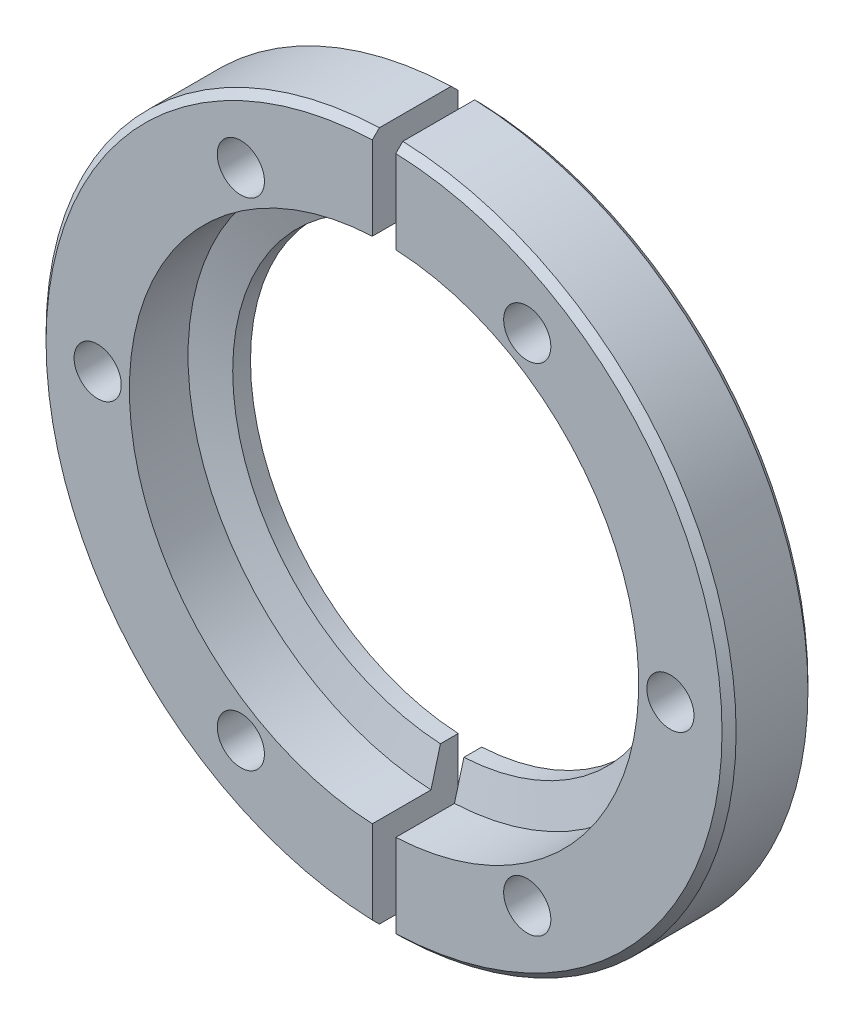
ISO-10303-21;
HEADER;
FILE_DESCRIPTION(('STEP AP214'),'2;1');
FILE_NAME('part.step','',(''),(''),'','','');
FILE_SCHEMA(('AUTOMOTIVE_DESIGN { 1 0 10303 214 1 1 1 1 }'));
ENDSEC;
DATA;
#1=APPLICATION_CONTEXT('core data for automotive mechanical design processes');
#2=APPLICATION_PROTOCOL_DEFINITION('international standard','automotive_design',2000,#1);
#3=PRODUCT_CONTEXT('',#1,'mechanical');
#4=PRODUCT('Part','Part','',(#3));
#5=PRODUCT_RELATED_PRODUCT_CATEGORY('part','',(#4));
#6=PRODUCT_DEFINITION_FORMATION('','',#4);
#7=PRODUCT_DEFINITION_CONTEXT('part definition',#1,'design');
#8=PRODUCT_DEFINITION('design','',#6,#7);
#9=PRODUCT_DEFINITION_SHAPE('','',#8);
#10=(LENGTH_UNIT() NAMED_UNIT(*) SI_UNIT(.MILLI.,.METRE.));
#11=(NAMED_UNIT(*) PLANE_ANGLE_UNIT() SI_UNIT($,.RADIAN.));
#12=(NAMED_UNIT(*) SI_UNIT($,.STERADIAN.) SOLID_ANGLE_UNIT());
#13=UNCERTAINTY_MEASURE_WITH_UNIT(LENGTH_MEASURE(1.E-05),#10,'distance_accuracy_value','');
#14=(GEOMETRIC_REPRESENTATION_CONTEXT(3) GLOBAL_UNCERTAINTY_ASSIGNED_CONTEXT((#13)) GLOBAL_UNIT_ASSIGNED_CONTEXT((#10,
#11,#12)) REPRESENTATION_CONTEXT('',''));
#15=CARTESIAN_POINT('',(0.,0.,0.));
#16=DIRECTION('',(0.,0.,1.));
#17=DIRECTION('',(1.,0.,0.));
#18=AXIS2_PLACEMENT_3D('',#15,#16,#17);
#19=CARTESIAN_POINT('',(-2.22044604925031E-13,-8.32667268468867E-13,8.53439999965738));
#20=DIRECTION('',(0.,0.,-0.999999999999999));
#21=DIRECTION('',(-1.,0.,0.));
#22=AXIS2_PLACEMENT_3D('',#19,#20,#21);
#23=CONICAL_SURFACE('',#22,37.3379999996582,0.785398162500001);
#24=CARTESIAN_POINT('',(2.22044604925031E-13,0.,8.53439999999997));
#25=DIRECTION('',(0.,0.,0.999999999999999));
#26=DIRECTION('',(1.,0.,0.));
#27=AXIS2_PLACEMENT_3D('',#24,#25,#26);
#28=CIRCLE('',#27,37.338);
#29=CARTESIAN_POINT('',(1.27000000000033,37.316395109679,8.53439999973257));
#30=VERTEX_POINT('',#29);
#31=CARTESIAN_POINT('',(1.27000000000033,-37.3163951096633,8.5343999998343));
#32=VERTEX_POINT('',#31);
#33=EDGE_CURVE('P0_E81',#30,#32,#28,.F.);
#34=ORIENTED_EDGE('',*,*,#33,.F.);
#35=CARTESIAN_POINT('',(1.26999999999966,37.3163951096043,8.53439999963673));
#36=CARTESIAN_POINT('',(1.26999999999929,37.1893208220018,8.66140077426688));
#37=CARTESIAN_POINT('',(1.26999999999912,37.0622461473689,8.78840116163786));
#38=CARTESIAN_POINT('',(1.2699999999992,36.8080960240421,9.04240116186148));
#39=CARTESIAN_POINT('',(1.26999999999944,36.6810205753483,9.16940077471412));
#40=CARTESIAN_POINT('',(1.26999999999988,36.553944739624,9.2964000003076));
#41=B_SPLINE_CURVE_WITH_KNOTS('',3,(#35,#36,#37,#38,#39,#40),.UNSPECIFIED.,.F.,.F.,(4,2,4),(0.,
0.538974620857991,1.07794924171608),.UNSPECIFIED.);
#42=CARTESIAN_POINT('',(1.26999999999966,36.5539447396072,9.29640000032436));
#43=VERTEX_POINT('',#42);
#44=EDGE_CURVE('P0_E28',#30,#43,#41,.T.);
#45=ORIENTED_EDGE('',*,*,#44,.T.);
#46=CARTESIAN_POINT('',(-4.44089209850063E-13,9.99200722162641E-13,9.29640000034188));
#47=DIRECTION('',(0.,0.,-0.999999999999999));
#48=DIRECTION('',(-1.,0.,0.));
#49=AXIS2_PLACEMENT_3D('',#46,#47,#48);
#50=CIRCLE('',#49,36.5760000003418);
#51=CARTESIAN_POINT('',(1.26999999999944,-36.5539447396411,9.29640000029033));
#52=VERTEX_POINT('',#51);
#53=EDGE_CURVE('P0_E85',#43,#52,#50,.T.);
#54=ORIENTED_EDGE('',*,*,#53,.T.);
#55=CARTESIAN_POINT('',(1.2700000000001,-36.5539447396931,9.2964000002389));
#56=CARTESIAN_POINT('',(1.26999999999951,-36.681020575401,9.16940077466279));
#57=CARTESIAN_POINT('',(1.26999999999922,-36.8080960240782,9.0424011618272));
#58=CARTESIAN_POINT('',(1.26999999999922,-37.0622461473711,8.78840116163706));
#59=CARTESIAN_POINT('',(1.26999999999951,-37.1893208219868,8.66140077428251));
#60=CARTESIAN_POINT('',(1.2700000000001,-37.3163951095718,8.53439999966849));
#61=B_SPLINE_CURVE_WITH_KNOTS('',3,(#55,#56,#57,#58,#59,#60),.UNSPECIFIED.,.F.,.F.,(4,2,4),(0.,
0.538974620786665,1.07794924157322),.UNSPECIFIED.);
#62=EDGE_CURVE('P0_E91',#52,#32,#61,.T.);
#63=ORIENTED_EDGE('',*,*,#62,.T.);
#64=EDGE_LOOP('',(#34,#45,#54,#63));
#65=FACE_BOUND('',#64,.T.);
#66=ADVANCED_FACE('P0_F24',(#65),#23,.T.);
#67=CARTESIAN_POINT('',(-2.22044604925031E-13,-3.33066907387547E-13,2.94640000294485));
#68=DIRECTION('',(0.,0.,0.999999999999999));
#69=DIRECTION('',(0.,-0.999999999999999,0.));
#70=AXIS2_PLACEMENT_3D('',#67,#68,#69);
#71=CONICAL_SURFACE('',#70,27.5589999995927,1.3089969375);
#72=CARTESIAN_POINT('',(-2.22044604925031E-13,1.11022302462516E-13,1.92551357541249));
#73=DIRECTION('',(0.,0.,0.999999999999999));
#74=DIRECTION('',(1.,0.,0.));
#75=AXIS2_PLACEMENT_3D('',#72,#73,#74);
#76=CIRCLE('',#75,23.749);
#77=CARTESIAN_POINT('',(1.26999999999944,23.7150184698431,1.92551357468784));
#78=VERTEX_POINT('',#77);
#79=CARTESIAN_POINT('',(1.26999999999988,-23.7150184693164,1.9255135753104));
#80=VERTEX_POINT('',#79);
#81=EDGE_CURVE('P0_E113',#78,#80,#76,.F.);
#82=ORIENTED_EDGE('',*,*,#81,.T.);
#83=CARTESIAN_POINT('',(1.26999999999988,-23.7150184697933,1.92551357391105));
#84=CARTESIAN_POINT('',(1.26999999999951,-24.350810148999,2.09563218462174));
#85=CARTESIAN_POINT('',(1.26999999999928,-24.9865979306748,2.26576535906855));
#86=CARTESIAN_POINT('',(1.26999999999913,-26.2581656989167,2.60606083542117));
#87=CARTESIAN_POINT('',(1.26999999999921,-26.8939456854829,2.77622313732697));
#88=CARTESIAN_POINT('',(1.26999999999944,-27.5297217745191,2.94640000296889));
#89=B_SPLINE_CURVE_WITH_KNOTS('',3,(#83,#84,#85,#86,#87,#88),.UNSPECIFIED.,.F.,.F.,(4,2,4),(0.,
1.97447274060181,3.94894548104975),.UNSPECIFIED.);
#90=CARTESIAN_POINT('',(1.26999999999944,-27.5297217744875,2.94640000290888));
#91=VERTEX_POINT('',#90);
#92=EDGE_CURVE('P0_E138',#80,#91,#89,.T.);
#93=ORIENTED_EDGE('',*,*,#92,.T.);
#94=CARTESIAN_POINT('',(-4.44089209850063E-13,0.,2.94640000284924));
#95=DIRECTION('',(0.,0.,-0.999999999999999));
#96=DIRECTION('',(-1.,0.,0.));
#97=AXIS2_PLACEMENT_3D('',#94,#95,#96);
#98=CIRCLE('',#97,27.559);
#99=CARTESIAN_POINT('',(1.2700000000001,27.5297217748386,2.94640000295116));
#100=VERTEX_POINT('',#99);
#101=EDGE_CURVE('P0_E102',#91,#100,#98,.F.);
#102=ORIENTED_EDGE('',*,*,#101,.T.);
#103=CARTESIAN_POINT('',(1.26999999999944,27.5297217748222,2.94640000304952));
#104=CARTESIAN_POINT('',(1.26999999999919,26.8939456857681,2.77622313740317));
#105=CARTESIAN_POINT('',(1.2699999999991,26.2581656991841,2.60606083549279));
#106=CARTESIAN_POINT('',(1.26999999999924,24.9865979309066,2.26576535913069));
#107=CARTESIAN_POINT('',(1.26999999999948,24.3508101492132,2.09563218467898));
#108=CARTESIAN_POINT('',(1.26999999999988,23.7150184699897,1.92551357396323));
#109=B_SPLINE_CURVE_WITH_KNOTS('',3,(#103,#104,#105,#106,#107,#108),.UNSPECIFIED.,.F.,.F.,(4,2,
4),(0.,1.97447274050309,3.94894548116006),.UNSPECIFIED.);
#110=EDGE_CURVE('P0_E111',#100,#78,#109,.T.);
#111=ORIENTED_EDGE('',*,*,#110,.T.);
#112=EDGE_LOOP('',(#82,#93,#102,#111));
#113=FACE_BOUND('',#112,.T.);
#114=ADVANCED_FACE('P0_F154',(#113),#71,.F.);
#115=CARTESIAN_POINT('',(0.,-2.77555756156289E-13,9.29640000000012));
#116=DIRECTION('',(0.,0.,-0.999999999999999));
#117=DIRECTION('',(-1.,0.,0.));
#118=AXIS2_PLACEMENT_3D('',#115,#116,#117);
#119=CYLINDRICAL_SURFACE('',#118,27.559);
#120=DIRECTION('',(0.,0.,-0.999999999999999));
#121=VECTOR('',#120,1.);
#122=CARTESIAN_POINT('',(1.26999999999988,27.5297217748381,9.29639999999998));
#123=LINE('',#122,#121);
#124=CARTESIAN_POINT('',(1.2700000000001,27.5297217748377,9.2964000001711));
#125=VERTEX_POINT('',#124);
#126=EDGE_CURVE('P0_E108',#125,#100,#123,.T.);
#127=ORIENTED_EDGE('',*,*,#126,.T.);
#128=ORIENTED_EDGE('',*,*,#101,.F.);
#129=DIRECTION('',(0.,0.,-0.999999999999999));
#130=VECTOR('',#129,1.);
#131=CARTESIAN_POINT('',(1.26999999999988,-27.529721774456,9.2964000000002));
#132=LINE('',#131,#130);
#133=CARTESIAN_POINT('',(1.26999999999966,-27.529721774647,9.29639999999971));
#134=VERTEX_POINT('',#133);
#135=EDGE_CURVE('P0_E146',#91,#134,#132,.F.);
#136=ORIENTED_EDGE('',*,*,#135,.T.);
#137=CARTESIAN_POINT('',(0.,-2.77555756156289E-13,9.29640000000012));
#138=DIRECTION('',(0.,0.,-0.999999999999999));
#139=DIRECTION('',(-1.,0.,0.));
#140=AXIS2_PLACEMENT_3D('',#137,#138,#139);
#141=CIRCLE('',#140,27.559);
#142=EDGE_CURVE('P0_E101',#134,#125,#141,.F.);
#143=ORIENTED_EDGE('',*,*,#142,.T.);
#144=EDGE_LOOP('',(#127,#128,#136,#143));
#145=FACE_BOUND('',#144,.T.);
#146=ADVANCED_FACE('P0_F217',(#145),#119,.F.);
#147=CARTESIAN_POINT('',(0.,-2.77555756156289E-13,9.29640000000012));
#148=DIRECTION('',(0.,0.,-0.999999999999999));
#149=DIRECTION('',(-1.,0.,0.));
#150=AXIS2_PLACEMENT_3D('',#147,#148,#149);
#151=PLANE('',#150);
#152=ORIENTED_EDGE('',*,*,#142,.F.);
#153=DIRECTION('',(0.,0.999999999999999,0.));
#154=VECTOR('',#153,1.);
#155=CARTESIAN_POINT('',(1.26999999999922,-38.1000000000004,9.29639999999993));
#156=LINE('',#155,#154);
#157=EDGE_CURVE('P0_E100',#134,#52,#156,.F.);
#158=ORIENTED_EDGE('',*,*,#157,.T.);
#159=ORIENTED_EDGE('',*,*,#53,.F.);
#160=DIRECTION('',(0.,0.999999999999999,0.));
#161=VECTOR('',#160,1.);
#162=CARTESIAN_POINT('',(1.26999999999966,-38.0999999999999,9.29640000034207));
#163=LINE('',#162,#161);
#164=EDGE_CURVE('P0_E97',#43,#125,#163,.F.);
#165=ORIENTED_EDGE('',*,*,#164,.T.);
#166=EDGE_LOOP('',(#152,#158,#159,#165));
#167=FACE_BOUND('',#166,.T.);
#168=CARTESIAN_POINT('',(30.988,4.9960036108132E-13,9.29639999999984));
#169=DIRECTION('',(0.,0.,-0.999999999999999));
#170=DIRECTION('',(-1.,0.,0.));
#171=AXIS2_PLACEMENT_3D('',#168,#169,#170);
#172=CIRCLE('',#171,2.5527);
#173=CARTESIAN_POINT('',(28.4353,4.97758217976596E-13,9.29639999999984));
#174=VERTEX_POINT('',#173);
#175=EDGE_CURVE('P0_E120',#174,#174,#172,.T.);
#176=ORIENTED_EDGE('',*,*,#175,.T.);
#177=EDGE_LOOP('',(#176));
#178=FACE_BOUND('',#177,.T.);
#179=CARTESIAN_POINT('',(15.4940000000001,26.8363952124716,9.29640000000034));
#180=DIRECTION('',(0.,0.,-0.999999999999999));
#181=DIRECTION('',(-1.,0.,0.));
#182=AXIS2_PLACEMENT_3D('',#179,#180,#181);
#183=CIRCLE('',#182,2.5527);
#184=CARTESIAN_POINT('',(12.9413000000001,26.8363952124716,9.29640000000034));
#185=VERTEX_POINT('',#184);
#186=EDGE_CURVE('P0_E175',#185,#185,#183,.T.);
#187=ORIENTED_EDGE('',*,*,#186,.T.);
#188=EDGE_LOOP('',(#187));
#189=FACE_BOUND('',#188,.T.);
#190=CARTESIAN_POINT('',(15.4939999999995,-26.8363952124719,9.29639999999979));
#191=DIRECTION('',(0.,0.,-0.999999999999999));
#192=DIRECTION('',(-1.,0.,0.));
#193=AXIS2_PLACEMENT_3D('',#190,#191,#192);
#194=CIRCLE('',#193,2.5527);
#195=CARTESIAN_POINT('',(12.9412999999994,-26.8363952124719,9.29639999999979));
#196=VERTEX_POINT('',#195);
#197=EDGE_CURVE('P0_E178',#196,#196,#194,.T.);
#198=ORIENTED_EDGE('',*,*,#197,.T.);
#199=EDGE_LOOP('',(#198));
#200=FACE_BOUND('',#199,.T.);
#201=ADVANCED_FACE('P0_F95',(#167,#178,#189,#200),#151,.F.);
#202=CARTESIAN_POINT('',(0.,0.,0.));
#203=DIRECTION('',(0.,0.,0.999999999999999));
#204=DIRECTION('',(1.,0.,0.));
#205=AXIS2_PLACEMENT_3D('',#202,#203,#204);
#206=CYLINDRICAL_SURFACE('',#205,37.338);
#207=ORIENTED_EDGE('',*,*,#33,.T.);
#208=DIRECTION('',(0.,0.,-0.999999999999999));
#209=VECTOR('',#208,1.);
#210=CARTESIAN_POINT('',(1.2700000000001,-37.3163951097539,9.29639999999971));
#211=LINE('',#210,#209);
#212=CARTESIAN_POINT('',(1.26999999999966,-37.3163951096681,0.762000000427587));
#213=VERTEX_POINT('',#212);
#214=EDGE_CURVE('P0_E137',#32,#213,#211,.T.);
#215=ORIENTED_EDGE('',*,*,#214,.T.);
#216=CARTESIAN_POINT('',(-8.88178419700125E-13,5.55111512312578E-13,0.76200000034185));
#217=DIRECTION('',(0.,0.,0.999999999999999));
#218=DIRECTION('',(1.,0.,0.));
#219=AXIS2_PLACEMENT_3D('',#216,#217,#218);
#220=CIRCLE('',#219,37.3379999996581);
#221=CARTESIAN_POINT('',(1.26999999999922,37.3163951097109,0.762000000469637));
#222=VERTEX_POINT('',#221);
#223=EDGE_CURVE('P0_E323',#222,#213,#220,.F.);
#224=ORIENTED_EDGE('',*,*,#223,.F.);
#225=DIRECTION('',(0.,0.,-0.999999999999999));
#226=VECTOR('',#225,1.);
#227=CARTESIAN_POINT('',(1.2700000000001,37.3163951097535,9.29639999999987));
#228=LINE('',#227,#226);
#229=EDGE_CURVE('P0_E109',#222,#30,#228,.F.);
#230=ORIENTED_EDGE('',*,*,#229,.T.);
#231=EDGE_LOOP('',(#207,#215,#224,#230));
#232=FACE_BOUND('',#231,.T.);
#233=ADVANCED_FACE('P0_F211',(#232),#206,.T.);
#234=CARTESIAN_POINT('',(30.988,4.9960036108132E-13,9.29639999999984));
#235=DIRECTION('',(0.,0.,-0.999999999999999));
#236=DIRECTION('',(-1.,0.,0.));
#237=AXIS2_PLACEMENT_3D('',#234,#235,#236);
#238=CYLINDRICAL_SURFACE('',#237,2.5527);
#239=CARTESIAN_POINT('',(30.9879999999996,1.11022302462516E-13,1.94289029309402E-13));
#240=DIRECTION('',(0.,0.,-0.999999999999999));
#241=DIRECTION('',(-1.,0.,0.));
#242=AXIS2_PLACEMENT_3D('',#239,#240,#241);
#243=CIRCLE('',#242,2.5527);
#244=CARTESIAN_POINT('',(28.4353,4.99564406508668E-13,1.92554305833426E-13));
#245=VERTEX_POINT('',#244);
#246=EDGE_CURVE('P0_E134',#245,#245,#243,.F.);
#247=CARTESIAN_POINT('',(28.4353,4.97758217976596E-13,9.29639999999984));
#248=CARTESIAN_POINT('',(28.4353,4.97777032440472E-13,9.19956249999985));
#249=CARTESIAN_POINT('',(28.4353,4.97795846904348E-13,9.10272499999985));
#250=CARTESIAN_POINT('',(28.4353,4.97833475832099E-13,8.90904999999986));
#251=CARTESIAN_POINT('',(28.4353,4.97852290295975E-13,8.81221249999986));
#252=CARTESIAN_POINT('',(28.4353,4.97889919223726E-13,8.61853749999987));
#253=CARTESIAN_POINT('',(28.4353,4.97908733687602E-13,8.52169999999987));
#254=CARTESIAN_POINT('',(28.4353,4.97946362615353E-13,8.32802499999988));
#255=CARTESIAN_POINT('',(28.4353,4.97965177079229E-13,8.23118749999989));
#256=CARTESIAN_POINT('',(28.4353,4.98002806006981E-13,8.03751249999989));
#257=CARTESIAN_POINT('',(28.4353,4.98021620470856E-13,7.9406749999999));
#258=CARTESIAN_POINT('',(28.4353,4.98059249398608E-13,7.7469999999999));
#259=CARTESIAN_POINT('',(28.4353,4.98078063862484E-13,7.65016249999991));
#260=CARTESIAN_POINT('',(28.4353,4.98115692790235E-13,7.45648749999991));
#261=CARTESIAN_POINT('',(28.4353,4.98134507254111E-13,7.35964999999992));
#262=CARTESIAN_POINT('',(28.4353,4.98172136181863E-13,7.16597499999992));
#263=CARTESIAN_POINT('',(28.4353,4.98190950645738E-13,7.06913749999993));
#264=CARTESIAN_POINT('',(28.4353,4.9822857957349E-13,6.87546249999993));
#265=CARTESIAN_POINT('',(28.4353,4.98247394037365E-13,6.77862499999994));
#266=CARTESIAN_POINT('',(28.4353,4.98285022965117E-13,6.58494999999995));
#267=CARTESIAN_POINT('',(28.4353,4.98303837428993E-13,6.48811249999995));
#268=CARTESIAN_POINT('',(28.4353,4.98341466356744E-13,6.29443749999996));
#269=CARTESIAN_POINT('',(28.4353,4.9836028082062E-13,6.19759999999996));
#270=CARTESIAN_POINT('',(28.4353,4.98397909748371E-13,6.00392499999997));
#271=CARTESIAN_POINT('',(28.4353,4.98416724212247E-13,5.90708749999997));
#272=CARTESIAN_POINT('',(28.4353,4.98454353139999E-13,5.71341249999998));
#273=CARTESIAN_POINT('',(28.4353,4.98473167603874E-13,5.61657499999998));
#274=CARTESIAN_POINT('',(28.4353,4.98510796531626E-13,5.42289999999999));
#275=CARTESIAN_POINT('',(28.4353,4.98529610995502E-13,5.32606249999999));
#276=CARTESIAN_POINT('',(28.4353,4.98567239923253E-13,5.1323875));
#277=CARTESIAN_POINT('',(28.4353,4.98586054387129E-13,5.03555));
#278=CARTESIAN_POINT('',(28.4353,4.9862368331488E-13,4.84187500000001));
#279=CARTESIAN_POINT('',(28.4353,4.98642497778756E-13,4.74503750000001));
#280=CARTESIAN_POINT('',(28.4353,4.98680126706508E-13,4.55136250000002));
#281=CARTESIAN_POINT('',(28.4353,4.98698941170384E-13,4.45452500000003));
#282=CARTESIAN_POINT('',(28.4353,4.98736570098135E-13,4.26085000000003));
#283=CARTESIAN_POINT('',(28.4353,4.98755384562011E-13,4.16401250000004));
#284=CARTESIAN_POINT('',(28.4353,4.98793013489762E-13,3.97033750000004));
#285=CARTESIAN_POINT('',(28.4353,4.98811827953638E-13,3.87350000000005));
#286=CARTESIAN_POINT('',(28.4353,4.98849456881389E-13,3.67982500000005));
#287=CARTESIAN_POINT('',(28.4353,4.98868271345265E-13,3.58298750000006));
#288=CARTESIAN_POINT('',(28.4353,4.98905900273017E-13,3.38931250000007));
#289=CARTESIAN_POINT('',(28.4353,4.98924714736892E-13,3.29247500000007));
#290=CARTESIAN_POINT('',(28.4353,4.98962343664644E-13,3.09880000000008));
#291=CARTESIAN_POINT('',(28.4353,4.9898115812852E-13,3.00196250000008));
#292=CARTESIAN_POINT('',(28.4353,4.99018787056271E-13,2.80828750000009));
#293=CARTESIAN_POINT('',(28.4353,4.99037601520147E-13,2.71145000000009));
#294=CARTESIAN_POINT('',(28.4353,4.99075230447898E-13,2.5177750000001));
#295=CARTESIAN_POINT('',(28.4353,4.99094044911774E-13,2.4209375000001));
#296=CARTESIAN_POINT('',(28.4353,4.99131673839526E-13,2.22726250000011));
#297=CARTESIAN_POINT('',(28.4353,4.99150488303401E-13,2.13042500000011));
#298=CARTESIAN_POINT('',(28.4353,4.99188117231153E-13,1.93675000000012));
#299=CARTESIAN_POINT('',(28.4353,4.99206931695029E-13,1.83991250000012));
#300=CARTESIAN_POINT('',(28.4353,4.9924456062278E-13,1.64623750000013));
#301=CARTESIAN_POINT('',(28.4353,4.99263375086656E-13,1.54940000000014));
#302=CARTESIAN_POINT('',(28.4353,4.99301004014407E-13,1.35572500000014));
#303=CARTESIAN_POINT('',(28.4353,4.99319818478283E-13,1.25888750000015));
#304=CARTESIAN_POINT('',(28.4353,4.99357447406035E-13,1.06521250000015));
#305=CARTESIAN_POINT('',(28.4353,4.9937626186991E-13,0.968375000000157));
#306=CARTESIAN_POINT('',(28.4353,4.99413890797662E-13,0.774700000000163));
#307=CARTESIAN_POINT('',(28.4353,4.99432705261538E-13,0.677862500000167));
#308=CARTESIAN_POINT('',(28.4353,4.99470334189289E-13,0.484187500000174));
#309=CARTESIAN_POINT('',(28.4353,4.99489148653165E-13,0.387350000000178));
#310=CARTESIAN_POINT('',(28.4353,4.99526777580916E-13,0.193675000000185));
#311=CARTESIAN_POINT('',(28.4353,4.99545592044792E-13,0.0968375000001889));
#312=CARTESIAN_POINT('',(28.4353,4.99564406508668E-13,1.92554305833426E-13));
#313=B_SPLINE_CURVE_WITH_KNOTS('',3,(#247,#248,#249,#250,#251,#252,#253,#254,#255,#256,#257,
#258,#259,#260,#261,#262,#263,#264,#265,#266,#267,#268,#269,#270,#271,#272,#273,#274,#275,#276,
#277,#278,#279,#280,#281,#282,#283,#284,#285,#286,#287,#288,#289,#290,#291,#292,#293,#294,#295,
#296,#297,#298,#299,#300,#301,#302,#303,#304,#305,#306,#307,#308,#309,#310,#311,#312),
.UNSPECIFIED.,.F.,.F.,(4,2,2,2,2,2,2,2,2,2,2,2,2,2,2,2,2,2,2,2,2,2,2,2,2,2,2,2,2,2,2,2,4),(0.,
0.290512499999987,0.581024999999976,0.871537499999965,1.16204999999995,1.45256249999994,
1.74307499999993,2.03358749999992,2.32409999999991,2.6146124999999,2.90512499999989,
3.19563749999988,3.48614999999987,3.77666249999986,4.06717499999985,4.35768749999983,
4.64819999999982,4.93871249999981,5.2292249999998,5.51973749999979,5.81024999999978,
6.10076249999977,6.39127499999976,6.68178749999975,6.97229999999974,7.26281249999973,
7.55332499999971,7.8438374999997,8.13434999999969,8.42486249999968,8.71537499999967,
9.00588749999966,9.29639999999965),.UNSPECIFIED.);
#314=EDGE_CURVE('P0_BSEAM207',#174,#245,#313,.T.);
#315=ORIENTED_EDGE('',*,*,#175,.F.);
#316=ORIENTED_EDGE('',*,*,#246,.F.);
#317=ORIENTED_EDGE('',*,*,#314,.T.);
#318=ORIENTED_EDGE('',*,*,#314,.F.);
#319=EDGE_LOOP('',(#315,#317,#316,#318));
#320=FACE_BOUND('',#319,.T.);
#321=ADVANCED_FACE('P0_F207',(#320),#238,.F.);
#322=CARTESIAN_POINT('',(15.4940000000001,26.8363952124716,9.29640000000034));
#323=DIRECTION('',(0.,0.,-0.999999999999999));
#324=DIRECTION('',(-1.,0.,0.));
#325=AXIS2_PLACEMENT_3D('',#322,#323,#324);
#326=CYLINDRICAL_SURFACE('',#325,2.5527);
#327=CARTESIAN_POINT('',(15.4939999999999,26.8363952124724,-1.66533453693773E-13));
#328=DIRECTION('',(0.,0.,-0.999999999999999));
#329=DIRECTION('',(-1.,0.,0.));
#330=AXIS2_PLACEMENT_3D('',#327,#328,#329);
#331=CIRCLE('',#330,2.5527);
#332=CARTESIAN_POINT('',(12.9413000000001,26.8363952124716,-1.6826817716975E-13));
#333=VERTEX_POINT('',#332);
#334=EDGE_CURVE('P0_E131',#333,#333,#331,.F.);
#335=CARTESIAN_POINT('',(12.9413000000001,26.8363952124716,9.29640000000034));
#336=CARTESIAN_POINT('',(12.9413000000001,26.8363952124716,9.19956250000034));
#337=CARTESIAN_POINT('',(12.9413000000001,26.8363952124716,9.10272500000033));
#338=CARTESIAN_POINT('',(12.9413000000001,26.8363952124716,8.90905000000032));
#339=CARTESIAN_POINT('',(12.9413000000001,26.8363952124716,8.81221250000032));
#340=CARTESIAN_POINT('',(12.9413000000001,26.8363952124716,8.6185375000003));
#341=CARTESIAN_POINT('',(12.9413000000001,26.8363952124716,8.5217000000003));
#342=CARTESIAN_POINT('',(12.9413000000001,26.8363952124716,8.32802500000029));
#343=CARTESIAN_POINT('',(12.9413000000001,26.8363952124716,8.23118750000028));
#344=CARTESIAN_POINT('',(12.9413000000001,26.8363952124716,8.03751250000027));
#345=CARTESIAN_POINT('',(12.9413000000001,26.8363952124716,7.94067500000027));
#346=CARTESIAN_POINT('',(12.9413000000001,26.8363952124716,7.74700000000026));
#347=CARTESIAN_POINT('',(12.9413000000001,26.8363952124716,7.65016250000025));
#348=CARTESIAN_POINT('',(12.9413000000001,26.8363952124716,7.45648750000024));
#349=CARTESIAN_POINT('',(12.9413000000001,26.8363952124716,7.35965000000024));
#350=CARTESIAN_POINT('',(12.9413000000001,26.8363952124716,7.16597500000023));
#351=CARTESIAN_POINT('',(12.9413000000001,26.8363952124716,7.06913750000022));
#352=CARTESIAN_POINT('',(12.9413000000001,26.8363952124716,6.87546250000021));
#353=CARTESIAN_POINT('',(12.9413000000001,26.8363952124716,6.7786250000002));
#354=CARTESIAN_POINT('',(12.9413000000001,26.8363952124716,6.58495000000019));
#355=CARTESIAN_POINT('',(12.9413000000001,26.8363952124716,6.48811250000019));
#356=CARTESIAN_POINT('',(12.9413000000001,26.8363952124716,6.29443750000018));
#357=CARTESIAN_POINT('',(12.9413000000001,26.8363952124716,6.19760000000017));
#358=CARTESIAN_POINT('',(12.9413000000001,26.8363952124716,6.00392500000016));
#359=CARTESIAN_POINT('',(12.9413000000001,26.8363952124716,5.90708750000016));
#360=CARTESIAN_POINT('',(12.9413000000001,26.8363952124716,5.71341250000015));
#361=CARTESIAN_POINT('',(12.9413000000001,26.8363952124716,5.61657500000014));
#362=CARTESIAN_POINT('',(12.9413000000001,26.8363952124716,5.42290000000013));
#363=CARTESIAN_POINT('',(12.9413000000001,26.8363952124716,5.32606250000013));
#364=CARTESIAN_POINT('',(12.9413000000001,26.8363952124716,5.13238750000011));
#365=CARTESIAN_POINT('',(12.9413000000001,26.8363952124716,5.03555000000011));
#366=CARTESIAN_POINT('',(12.9413000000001,26.8363952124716,4.8418750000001));
#367=CARTESIAN_POINT('',(12.9413000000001,26.8363952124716,4.74503750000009));
#368=CARTESIAN_POINT('',(12.9413000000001,26.8363952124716,4.55136250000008));
#369=CARTESIAN_POINT('',(12.9413000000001,26.8363952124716,4.45452500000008));
#370=CARTESIAN_POINT('',(12.9413000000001,26.8363952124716,4.26085000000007));
#371=CARTESIAN_POINT('',(12.9413000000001,26.8363952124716,4.16401250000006));
#372=CARTESIAN_POINT('',(12.9413000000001,26.8363952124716,3.97033750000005));
#373=CARTESIAN_POINT('',(12.9413000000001,26.8363952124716,3.87350000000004));
#374=CARTESIAN_POINT('',(12.9413000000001,26.8363952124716,3.67982500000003));
#375=CARTESIAN_POINT('',(12.9413000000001,26.8363952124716,3.58298750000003));
#376=CARTESIAN_POINT('',(12.9413000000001,26.8363952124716,3.38931250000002));
#377=CARTESIAN_POINT('',(12.9413000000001,26.8363952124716,3.29247500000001));
#378=CARTESIAN_POINT('',(12.9413000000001,26.8363952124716,3.0988));
#379=CARTESIAN_POINT('',(12.9413000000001,26.8363952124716,3.0019625));
#380=CARTESIAN_POINT('',(12.9413000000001,26.8363952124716,2.80828749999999));
#381=CARTESIAN_POINT('',(12.9413000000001,26.8363952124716,2.71144999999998));
#382=CARTESIAN_POINT('',(12.9413000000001,26.8363952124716,2.51777499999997));
#383=CARTESIAN_POINT('',(12.9413000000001,26.8363952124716,2.42093749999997));
#384=CARTESIAN_POINT('',(12.9413000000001,26.8363952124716,2.22726249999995));
#385=CARTESIAN_POINT('',(12.9413000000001,26.8363952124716,2.13042499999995));
#386=CARTESIAN_POINT('',(12.9413000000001,26.8363952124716,1.93674999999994));
#387=CARTESIAN_POINT('',(12.9413000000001,26.8363952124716,1.83991249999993));
#388=CARTESIAN_POINT('',(12.9413000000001,26.8363952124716,1.64623749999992));
#389=CARTESIAN_POINT('',(12.9413000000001,26.8363952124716,1.54939999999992));
#390=CARTESIAN_POINT('',(12.9413000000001,26.8363952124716,1.35572499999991));
#391=CARTESIAN_POINT('',(12.9413000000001,26.8363952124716,1.2588874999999));
#392=CARTESIAN_POINT('',(12.9413000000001,26.8363952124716,1.06521249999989));
#393=CARTESIAN_POINT('',(12.9413000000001,26.8363952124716,0.968374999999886));
#394=CARTESIAN_POINT('',(12.9413000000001,26.8363952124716,0.774699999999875));
#395=CARTESIAN_POINT('',(12.9413000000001,26.8363952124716,0.677862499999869));
#396=CARTESIAN_POINT('',(12.9413000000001,26.8363952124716,0.484187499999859));
#397=CARTESIAN_POINT('',(12.9413000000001,26.8363952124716,0.387349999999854));
#398=CARTESIAN_POINT('',(12.9413000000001,26.8363952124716,0.193674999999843));
#399=CARTESIAN_POINT('',(12.9413000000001,26.8363952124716,0.0968374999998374));
#400=CARTESIAN_POINT('',(12.9413000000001,26.8363952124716,-1.6826817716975E-13));
#401=B_SPLINE_CURVE_WITH_KNOTS('',3,(#335,#336,#337,#338,#339,#340,#341,#342,#343,#344,#345,
#346,#347,#348,#349,#350,#351,#352,#353,#354,#355,#356,#357,#358,#359,#360,#361,#362,#363,#364,
#365,#366,#367,#368,#369,#370,#371,#372,#373,#374,#375,#376,#377,#378,#379,#380,#381,#382,#383,
#384,#385,#386,#387,#388,#389,#390,#391,#392,#393,#394,#395,#396,#397,#398,#399,#400),
.UNSPECIFIED.,.F.,.F.,(4,2,2,2,2,2,2,2,2,2,2,2,2,2,2,2,2,2,2,2,2,2,2,2,2,2,2,2,2,2,2,2,4),(0.,
0.290512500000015,0.581025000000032,0.871537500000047,1.16205000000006,1.45256250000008,
1.74307500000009,2.03358750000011,2.32410000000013,2.61461250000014,2.90512500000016,
3.19563750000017,3.48615000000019,3.77666250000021,4.06717500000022,4.35768750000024,
4.64820000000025,4.93871250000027,5.22922500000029,5.5197375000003,5.81025000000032,
6.10076250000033,6.39127500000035,6.68178750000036,6.97230000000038,7.2628125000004,
7.55332500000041,7.84383750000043,8.13435000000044,8.42486250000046,8.71537500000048,
9.00588750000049,9.29640000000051),.UNSPECIFIED.);
#402=EDGE_CURVE('P0_BSEAM203',#185,#333,#401,.T.);
#403=ORIENTED_EDGE('',*,*,#186,.F.);
#404=ORIENTED_EDGE('',*,*,#334,.F.);
#405=ORIENTED_EDGE('',*,*,#402,.T.);
#406=ORIENTED_EDGE('',*,*,#402,.F.);
#407=EDGE_LOOP('',(#403,#405,#404,#406));
#408=FACE_BOUND('',#407,.T.);
#409=ADVANCED_FACE('P0_F203',(#408),#326,.F.);
#410=CARTESIAN_POINT('',(15.4939999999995,-26.8363952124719,9.29639999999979));
#411=DIRECTION('',(0.,0.,-0.999999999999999));
#412=DIRECTION('',(-1.,0.,0.));
#413=AXIS2_PLACEMENT_3D('',#410,#411,#412);
#414=CYLINDRICAL_SURFACE('',#413,2.5527);
#415=CARTESIAN_POINT('',(15.4939999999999,-26.8363952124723,-4.44089209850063E-13));
#416=DIRECTION('',(0.,0.,-0.999999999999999));
#417=DIRECTION('',(-1.,0.,0.));
#418=AXIS2_PLACEMENT_3D('',#415,#416,#417);
#419=CIRCLE('',#418,2.5527);
#420=CARTESIAN_POINT('',(12.9412999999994,-26.8363952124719,-4.45823933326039E-13));
#421=VERTEX_POINT('',#420);
#422=EDGE_CURVE('P0_E128',#421,#421,#419,.F.);
#423=CARTESIAN_POINT('',(12.9412999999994,-26.8363952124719,9.29639999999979));
#424=CARTESIAN_POINT('',(12.9412999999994,-26.8363952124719,9.19956249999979));
#425=CARTESIAN_POINT('',(12.9412999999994,-26.8363952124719,9.10272499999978));
#426=CARTESIAN_POINT('',(12.9412999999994,-26.8363952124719,8.90904999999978));
#427=CARTESIAN_POINT('',(12.9412999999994,-26.8363952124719,8.81221249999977));
#428=CARTESIAN_POINT('',(12.9412999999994,-26.8363952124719,8.61853749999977));
#429=CARTESIAN_POINT('',(12.9412999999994,-26.8363952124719,8.52169999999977));
#430=CARTESIAN_POINT('',(12.9412999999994,-26.8363952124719,8.32802499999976));
#431=CARTESIAN_POINT('',(12.9412999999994,-26.8363952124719,8.23118749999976));
#432=CARTESIAN_POINT('',(12.9412999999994,-26.8363952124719,8.03751249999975));
#433=CARTESIAN_POINT('',(12.9412999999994,-26.8363952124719,7.94067499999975));
#434=CARTESIAN_POINT('',(12.9412999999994,-26.8363952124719,7.74699999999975));
#435=CARTESIAN_POINT('',(12.9412999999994,-26.8363952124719,7.65016249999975));
#436=CARTESIAN_POINT('',(12.9412999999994,-26.8363952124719,7.45648749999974));
#437=CARTESIAN_POINT('',(12.9412999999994,-26.8363952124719,7.35964999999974));
#438=CARTESIAN_POINT('',(12.9412999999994,-26.8363952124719,7.16597499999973));
#439=CARTESIAN_POINT('',(12.9412999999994,-26.8363952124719,7.06913749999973));
#440=CARTESIAN_POINT('',(12.9412999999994,-26.8363952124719,6.87546249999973));
#441=CARTESIAN_POINT('',(12.9412999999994,-26.8363952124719,6.77862499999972));
#442=CARTESIAN_POINT('',(12.9412999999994,-26.8363952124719,6.58494999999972));
#443=CARTESIAN_POINT('',(12.9412999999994,-26.8363952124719,6.48811249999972));
#444=CARTESIAN_POINT('',(12.9412999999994,-26.8363952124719,6.29443749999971));
#445=CARTESIAN_POINT('',(12.9412999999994,-26.8363952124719,6.19759999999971));
#446=CARTESIAN_POINT('',(12.9412999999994,-26.8363952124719,6.0039249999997));
#447=CARTESIAN_POINT('',(12.9412999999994,-26.8363952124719,5.9070874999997));
#448=CARTESIAN_POINT('',(12.9412999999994,-26.8363952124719,5.7134124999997));
#449=CARTESIAN_POINT('',(12.9412999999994,-26.8363952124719,5.6165749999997));
#450=CARTESIAN_POINT('',(12.9412999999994,-26.8363952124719,5.42289999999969));
#451=CARTESIAN_POINT('',(12.9412999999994,-26.8363952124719,5.32606249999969));
#452=CARTESIAN_POINT('',(12.9412999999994,-26.8363952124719,5.13238749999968));
#453=CARTESIAN_POINT('',(12.9412999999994,-26.8363952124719,5.03554999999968));
#454=CARTESIAN_POINT('',(12.9412999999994,-26.8363952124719,4.84187499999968));
#455=CARTESIAN_POINT('',(12.9412999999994,-26.8363952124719,4.74503749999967));
#456=CARTESIAN_POINT('',(12.9412999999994,-26.8363952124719,4.55136249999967));
#457=CARTESIAN_POINT('',(12.9412999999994,-26.8363952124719,4.45452499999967));
#458=CARTESIAN_POINT('',(12.9412999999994,-26.8363952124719,4.26084999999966));
#459=CARTESIAN_POINT('',(12.9412999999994,-26.8363952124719,4.16401249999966));
#460=CARTESIAN_POINT('',(12.9412999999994,-26.8363952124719,3.97033749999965));
#461=CARTESIAN_POINT('',(12.9412999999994,-26.8363952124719,3.87349999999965));
#462=CARTESIAN_POINT('',(12.9412999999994,-26.8363952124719,3.67982499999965));
#463=CARTESIAN_POINT('',(12.9412999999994,-26.8363952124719,3.58298749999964));
#464=CARTESIAN_POINT('',(12.9412999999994,-26.8363952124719,3.38931249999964));
#465=CARTESIAN_POINT('',(12.9412999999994,-26.8363952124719,3.29247499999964));
#466=CARTESIAN_POINT('',(12.9412999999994,-26.8363952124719,3.09879999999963));
#467=CARTESIAN_POINT('',(12.9412999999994,-26.8363952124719,3.00196249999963));
#468=CARTESIAN_POINT('',(12.9412999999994,-26.8363952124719,2.80828749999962));
#469=CARTESIAN_POINT('',(12.9412999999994,-26.8363952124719,2.71144999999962));
#470=CARTESIAN_POINT('',(12.9412999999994,-26.8363952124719,2.51777499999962));
#471=CARTESIAN_POINT('',(12.9412999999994,-26.8363952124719,2.42093749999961));
#472=CARTESIAN_POINT('',(12.9412999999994,-26.8363952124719,2.22726249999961));
#473=CARTESIAN_POINT('',(12.9412999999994,-26.8363952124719,2.13042499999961));
#474=CARTESIAN_POINT('',(12.9412999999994,-26.8363952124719,1.9367499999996));
#475=CARTESIAN_POINT('',(12.9412999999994,-26.8363952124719,1.8399124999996));
#476=CARTESIAN_POINT('',(12.9412999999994,-26.8363952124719,1.6462374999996));
#477=CARTESIAN_POINT('',(12.9412999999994,-26.8363952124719,1.54939999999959));
#478=CARTESIAN_POINT('',(12.9412999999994,-26.8363952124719,1.35572499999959));
#479=CARTESIAN_POINT('',(12.9412999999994,-26.8363952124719,1.25888749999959));
#480=CARTESIAN_POINT('',(12.9412999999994,-26.8363952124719,1.06521249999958));
#481=CARTESIAN_POINT('',(12.9412999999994,-26.8363952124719,0.96837499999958));
#482=CARTESIAN_POINT('',(12.9412999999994,-26.8363952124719,0.774699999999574));
#483=CARTESIAN_POINT('',(12.9412999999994,-26.8363952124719,0.677862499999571));
#484=CARTESIAN_POINT('',(12.9412999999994,-26.8363952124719,0.484187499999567));
#485=CARTESIAN_POINT('',(12.9412999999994,-26.8363952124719,0.387349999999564));
#486=CARTESIAN_POINT('',(12.9412999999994,-26.8363952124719,0.19367499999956));
#487=CARTESIAN_POINT('',(12.9412999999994,-26.8363952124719,0.0968374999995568));
#488=CARTESIAN_POINT('',(12.9412999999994,-26.8363952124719,-4.45823933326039E-13));
#489=B_SPLINE_CURVE_WITH_KNOTS('',3,(#423,#424,#425,#426,#427,#428,#429,#430,#431,#432,#433,
#434,#435,#436,#437,#438,#439,#440,#441,#442,#443,#444,#445,#446,#447,#448,#449,#450,#451,#452,
#453,#454,#455,#456,#457,#458,#459,#460,#461,#462,#463,#464,#465,#466,#467,#468,#469,#470,#471,
#472,#473,#474,#475,#476,#477,#478,#479,#480,#481,#482,#483,#484,#485,#486,#487,#488),
.UNSPECIFIED.,.F.,.F.,(4,2,2,2,2,2,2,2,2,2,2,2,2,2,2,2,2,2,2,2,2,2,2,2,2,2,2,2,2,2,2,2,4),(0.,
0.290512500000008,0.581025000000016,0.871537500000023,1.16205000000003,1.45256250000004,
1.74307500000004,2.03358750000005,2.32410000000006,2.61461250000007,2.90512500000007,
3.19563750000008,3.48615000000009,3.7766625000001,4.0671750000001,4.35768750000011,
4.64820000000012,4.93871250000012,5.22922500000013,5.51973750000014,5.81025000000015,
6.10076250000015,6.39127500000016,6.68178750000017,6.97230000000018,7.26281250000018,
7.55332500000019,7.8438375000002,8.1343500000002,8.42486250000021,8.71537500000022,
9.00588750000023,9.29640000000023),.UNSPECIFIED.);
#490=EDGE_CURVE('P0_BSEAM199',#196,#421,#489,.T.);
#491=ORIENTED_EDGE('',*,*,#197,.F.);
#492=ORIENTED_EDGE('',*,*,#422,.F.);
#493=ORIENTED_EDGE('',*,*,#490,.T.);
#494=ORIENTED_EDGE('',*,*,#490,.F.);
#495=EDGE_LOOP('',(#491,#493,#492,#494));
#496=FACE_BOUND('',#495,.T.);
#497=ADVANCED_FACE('P0_F199',(#496),#414,.F.);
#498=CARTESIAN_POINT('',(0.,0.,0.));
#499=DIRECTION('',(0.,0.,0.999999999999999));
#500=DIRECTION('',(1.,0.,0.));
#501=AXIS2_PLACEMENT_3D('',#498,#499,#500);
#502=CYLINDRICAL_SURFACE('',#501,23.749);
#503=DIRECTION('',(0.,0.,-0.999999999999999));
#504=VECTOR('',#503,1.);
#505=CARTESIAN_POINT('',(1.26999999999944,23.7150184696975,9.2963999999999));
#506=LINE('',#505,#504);
#507=CARTESIAN_POINT('',(1.26999999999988,23.715018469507,0.));
#508=VERTEX_POINT('',#507);
#509=EDGE_CURVE('P0_E184',#78,#508,#506,.T.);
#510=ORIENTED_EDGE('',*,*,#509,.T.);
#511=CARTESIAN_POINT('',(0.,0.,0.));
#512=DIRECTION('',(0.,0.,0.999999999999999));
#513=DIRECTION('',(1.,0.,0.));
#514=AXIS2_PLACEMENT_3D('',#511,#512,#513);
#515=CIRCLE('',#514,23.749);
#516=CARTESIAN_POINT('',(1.2700000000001,-23.7150184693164,-4.71844785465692E-13));
#517=VERTEX_POINT('',#516);
#518=EDGE_CURVE('P0_E125',#517,#508,#515,.T.);
#519=ORIENTED_EDGE('',*,*,#518,.F.);
#520=DIRECTION('',(0.,0.,-0.999999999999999));
#521=VECTOR('',#520,1.);
#522=CARTESIAN_POINT('',(1.2700000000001,-23.7150184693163,9.29639999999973));
#523=LINE('',#522,#521);
#524=EDGE_CURVE('P0_E147',#517,#80,#523,.F.);
#525=ORIENTED_EDGE('',*,*,#524,.T.);
#526=ORIENTED_EDGE('',*,*,#81,.F.);
#527=EDGE_LOOP('',(#510,#519,#525,#526));
#528=FACE_BOUND('',#527,.T.);
#529=ADVANCED_FACE('P0_F193',(#528),#502,.F.);
#530=CARTESIAN_POINT('',(1.26999999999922,-38.1000000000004,9.29639999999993));
#531=DIRECTION('',(1.,0.,0.));
#532=DIRECTION('',(0.,0.,-0.999999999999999));
#533=AXIS2_PLACEMENT_3D('',#530,#531,#532);
#534=PLANE('',#533);
#535=ORIENTED_EDGE('',*,*,#509,.F.);
#536=ORIENTED_EDGE('',*,*,#110,.F.);
#537=ORIENTED_EDGE('',*,*,#126,.F.);
#538=ORIENTED_EDGE('',*,*,#164,.F.);
#539=ORIENTED_EDGE('',*,*,#44,.F.);
#540=ORIENTED_EDGE('',*,*,#229,.F.);
#541=CARTESIAN_POINT('',(1.26999999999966,36.5539447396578,-2.73975286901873E-10));
#542=CARTESIAN_POINT('',(1.26999999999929,36.6810205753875,0.126999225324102));
#543=CARTESIAN_POINT('',(1.26999999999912,36.8080960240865,0.253998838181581));
#544=CARTESIAN_POINT('',(1.2699999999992,37.0622461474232,0.507998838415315));
#545=CARTESIAN_POINT('',(1.26999999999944,37.1893208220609,0.63499922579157));
#546=CARTESIAN_POINT('',(1.26999999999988,37.3163951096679,0.762000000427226));
#547=B_SPLINE_CURVE_WITH_KNOTS('',3,(#541,#542,#543,#544,#545,#546),.UNSPECIFIED.,.F.,.F.,(4,2,
4),(0.,0.538974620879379,1.07794924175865),.UNSPECIFIED.);
#548=CARTESIAN_POINT('',(1.26999999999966,36.553944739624,-3.08003622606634E-10));
#549=VERTEX_POINT('',#548);
#550=EDGE_CURVE('P0_E185',#549,#222,#547,.T.);
#551=ORIENTED_EDGE('',*,*,#550,.F.);
#552=DIRECTION('',(0.,0.999999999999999,0.));
#553=VECTOR('',#552,1.);
#554=CARTESIAN_POINT('',(1.2700000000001,4.9960036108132E-13,0.));
#555=LINE('',#554,#553);
#556=EDGE_CURVE('P0_E124',#508,#549,#555,.T.);
#557=ORIENTED_EDGE('',*,*,#556,.F.);
#558=EDGE_LOOP('',(#535,#536,#537,#538,#539,#540,#551,#557));
#559=FACE_BOUND('',#558,.T.);
#560=ADVANCED_FACE('P0_F105',(#559),#534,.F.);
#561=CARTESIAN_POINT('',(-6.66133814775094E-13,1.11022302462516E-13,0.76200000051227));
#562=DIRECTION('',(0.,0.,0.999999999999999));
#563=DIRECTION('',(1.,0.,0.));
#564=AXIS2_PLACEMENT_3D('',#561,#562,#563);
#565=CONICAL_SURFACE('',#564,37.3379999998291,0.7853981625);
#566=ORIENTED_EDGE('',*,*,#223,.T.);
#567=CARTESIAN_POINT('',(1.26999999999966,-37.3163951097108,0.762000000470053));
#568=CARTESIAN_POINT('',(1.26999999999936,-37.1893208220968,0.634999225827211));
#569=CARTESIAN_POINT('',(1.26999999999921,-37.0622461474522,0.507998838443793));
#570=CARTESIAN_POINT('',(1.26999999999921,-36.8080960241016,0.253998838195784));
#571=CARTESIAN_POINT('',(1.26999999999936,-36.6810205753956,0.126999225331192));
#572=CARTESIAN_POINT('',(1.26999999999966,-36.5539447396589,-2.73975286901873E-10));
#573=B_SPLINE_CURVE_WITH_KNOTS('',3,(#567,#568,#569,#570,#571,#572),.UNSPECIFIED.,.F.,.F.,(4,2,
4),(0.,0.538974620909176,1.07794924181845),.UNSPECIFIED.);
#574=CARTESIAN_POINT('',(1.26999999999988,-36.5539447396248,-3.08170156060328E-10));
#575=VERTEX_POINT('',#574);
#576=EDGE_CURVE('P0_E148',#213,#575,#573,.T.);
#577=ORIENTED_EDGE('',*,*,#576,.T.);
#578=CARTESIAN_POINT('',(-4.44089209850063E-13,-4.44089209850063E-13,-3.42198491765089E-10));
#579=DIRECTION('',(0.,0.,0.999999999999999));
#580=DIRECTION('',(0.,-0.999999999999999,0.));
#581=AXIS2_PLACEMENT_3D('',#578,#579,#580);
#582=CIRCLE('',#581,36.5760000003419);
#583=EDGE_CURVE('P0_E38',#549,#575,#582,.F.);
#584=ORIENTED_EDGE('',*,*,#583,.F.);
#585=ORIENTED_EDGE('',*,*,#550,.T.);
#586=EDGE_LOOP('',(#566,#577,#584,#585));
#587=FACE_BOUND('',#586,.T.);
#588=ADVANCED_FACE('P0_F162',(#587),#565,.T.);
#589=CARTESIAN_POINT('',(1.26999999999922,-38.1000000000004,9.29639999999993));
#590=DIRECTION('',(1.,0.,0.));
#591=DIRECTION('',(0.,0.,-0.999999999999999));
#592=AXIS2_PLACEMENT_3D('',#589,#590,#591);
#593=PLANE('',#592);
#594=ORIENTED_EDGE('',*,*,#62,.F.);
#595=ORIENTED_EDGE('',*,*,#157,.F.);
#596=ORIENTED_EDGE('',*,*,#135,.F.);
#597=ORIENTED_EDGE('',*,*,#92,.F.);
#598=ORIENTED_EDGE('',*,*,#524,.F.);
#599=DIRECTION('',(0.,0.999999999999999,0.));
#600=VECTOR('',#599,1.);
#601=CARTESIAN_POINT('',(1.2700000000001,4.9960036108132E-13,0.));
#602=LINE('',#601,#600);
#603=EDGE_CURVE('P0_E13',#575,#517,#602,.T.);
#604=ORIENTED_EDGE('',*,*,#603,.F.);
#605=ORIENTED_EDGE('',*,*,#576,.F.);
#606=ORIENTED_EDGE('',*,*,#214,.F.);
#607=EDGE_LOOP('',(#594,#595,#596,#597,#598,#604,#605,#606));
#608=FACE_BOUND('',#607,.T.);
#609=ADVANCED_FACE('P0_F157',(#608),#593,.F.);
#610=CARTESIAN_POINT('',(0.,0.,0.));
#611=DIRECTION('',(0.,0.,-0.999999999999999));
#612=DIRECTION('',(-1.,0.,0.));
#613=AXIS2_PLACEMENT_3D('',#610,#611,#612);
#614=PLANE('',#613);
#615=ORIENTED_EDGE('',*,*,#583,.T.);
#616=ORIENTED_EDGE('',*,*,#603,.T.);
#617=ORIENTED_EDGE('',*,*,#518,.T.);
#618=ORIENTED_EDGE('',*,*,#556,.T.);
#619=EDGE_LOOP('',(#615,#616,#617,#618));
#620=FACE_BOUND('',#619,.T.);
#621=ORIENTED_EDGE('',*,*,#422,.T.);
#622=EDGE_LOOP('',(#621));
#623=FACE_BOUND('',#622,.T.);
#624=ORIENTED_EDGE('',*,*,#334,.T.);
#625=EDGE_LOOP('',(#624));
#626=FACE_BOUND('',#625,.T.);
#627=ORIENTED_EDGE('',*,*,#246,.T.);
#628=EDGE_LOOP('',(#627));
#629=FACE_BOUND('',#628,.T.);
#630=ADVANCED_FACE('P0_F161',(#620,#623,#626,#629),#614,.T.);
#631=CLOSED_SHELL('',(#66,#114,#146,#201,#233,#321,#409,#497,#529,#560,#588,#609,#630));
#632=MANIFOLD_SOLID_BREP('P0_B1',#631);
#633=CARTESIAN_POINT('',(2.22044604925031E-13,0.,8.53439999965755));
#634=DIRECTION('',(0.,0.,-0.999999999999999));
#635=DIRECTION('',(-1.,0.,0.));
#636=AXIS2_PLACEMENT_3D('',#633,#634,#635);
#637=CONICAL_SURFACE('',#636,37.3379999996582,0.785398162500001);
#638=CARTESIAN_POINT('',(-1.26999999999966,36.5539447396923,9.29640000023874));
#639=CARTESIAN_POINT('',(-1.2699999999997,36.6810205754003,9.16940077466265));
#640=CARTESIAN_POINT('',(-1.26999999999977,36.8080960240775,9.0424011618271));
#641=CARTESIAN_POINT('',(-1.26999999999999,37.0622461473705,8.78840116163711));
#642=CARTESIAN_POINT('',(-1.27000000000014,37.1893208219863,8.66140077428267));
#643=CARTESIAN_POINT('',(-1.27000000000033,37.3163951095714,8.53439999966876));
#644=B_SPLINE_CURVE_WITH_KNOTS('',3,(#638,#639,#640,#641,#642,#643),.UNSPECIFIED.,.F.,.F.,(4,2,
4),(0.,0.538974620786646,1.07794924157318),.UNSPECIFIED.);
#645=CARTESIAN_POINT('',(-1.27000000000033,36.5539447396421,9.29640000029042));
#646=VERTEX_POINT('',#645);
#647=CARTESIAN_POINT('',(-1.26999999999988,37.3163951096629,8.53439999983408));
#648=VERTEX_POINT('',#647);
#649=EDGE_CURVE('P1_E105',#646,#648,#644,.T.);
#650=ORIENTED_EDGE('',*,*,#649,.T.);
#651=CARTESIAN_POINT('',(-6.66133814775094E-13,-4.44089209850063E-13,8.53439999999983));
#652=DIRECTION('',(0.,0.,0.999999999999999));
#653=DIRECTION('',(1.,0.,0.));
#654=AXIS2_PLACEMENT_3D('',#651,#652,#653);
#655=CIRCLE('',#654,37.338);
#656=CARTESIAN_POINT('',(-1.27000000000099,-37.3163951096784,8.53439999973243));
#657=VERTEX_POINT('',#656);
#658=EDGE_CURVE('P1_E85',#657,#648,#655,.F.);
#659=ORIENTED_EDGE('',*,*,#658,.F.);
#660=CARTESIAN_POINT('',(-1.2700000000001,-37.3163951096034,8.53439999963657));
#661=CARTESIAN_POINT('',(-1.26999999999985,-37.1893208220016,8.66140077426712));
#662=CARTESIAN_POINT('',(-1.26999999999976,-37.0622461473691,8.78840116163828));
#663=CARTESIAN_POINT('',(-1.26999999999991,-36.808096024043,9.04240116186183));
#664=CARTESIAN_POINT('',(-1.27000000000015,-36.6810205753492,9.16940077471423));
#665=CARTESIAN_POINT('',(-1.27000000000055,-36.5539447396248,9.29640000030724));
#666=B_SPLINE_CURVE_WITH_KNOTS('',3,(#660,#661,#662,#663,#664,#665),.UNSPECIFIED.,.F.,.F.,(4,2,
4),(0.,0.538974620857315,1.07794924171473),.UNSPECIFIED.);
#667=CARTESIAN_POINT('',(-1.27000000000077,-36.5539447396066,9.29640000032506));
#668=VERTEX_POINT('',#667);
#669=EDGE_CURVE('P1_E30',#657,#668,#666,.T.);
#670=ORIENTED_EDGE('',*,*,#669,.T.);
#671=CARTESIAN_POINT('',(-2.22044604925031E-13,-4.44089209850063E-13,9.29640000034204));
#672=DIRECTION('',(0.,0.,-0.999999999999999));
#673=DIRECTION('',(-1.,0.,0.));
#674=AXIS2_PLACEMENT_3D('',#671,#672,#673);
#675=CIRCLE('',#674,36.5760000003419);
#676=EDGE_CURVE('P1_E92',#668,#646,#675,.T.);
#677=ORIENTED_EDGE('',*,*,#676,.T.);
#678=EDGE_LOOP('',(#650,#659,#670,#677));
#679=FACE_BOUND('',#678,.T.);
#680=ADVANCED_FACE('P1_F26',(#679),#637,.T.);
#681=CARTESIAN_POINT('',(-4.44089209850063E-13,-4.44089209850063E-13,2.94640000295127));
#682=DIRECTION('',(0.,0.,0.999999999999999));
#683=DIRECTION('',(1.,0.,0.));
#684=AXIS2_PLACEMENT_3D('',#681,#682,#683);
#685=CONICAL_SURFACE('',#684,27.5589999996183,1.3089969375);
#686=CARTESIAN_POINT('',(-1.2700000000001,23.7150184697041,1.92551357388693));
#687=CARTESIAN_POINT('',(-1.26999999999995,24.3508101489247,2.09563218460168));
#688=CARTESIAN_POINT('',(-1.26999999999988,24.9865979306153,2.26576535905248));
#689=CARTESIAN_POINT('',(-1.26999999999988,26.258165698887,2.60606083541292));
#690=CARTESIAN_POINT('',(-1.26999999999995,26.8939456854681,2.77622313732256));
#691=CARTESIAN_POINT('',(-1.2700000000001,27.5297217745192,2.94640000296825));
#692=B_SPLINE_CURVE_WITH_KNOTS('',3,(#686,#687,#688,#689,#690,#691),.UNSPECIFIED.,.F.,.F.,(4,2,
4),(0.,1.97447274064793,3.94894548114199),.UNSPECIFIED.);
#693=CARTESIAN_POINT('',(-1.27000000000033,23.715018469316,1.92551357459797));
#694=VERTEX_POINT('',#693);
#695=CARTESIAN_POINT('',(-1.27000000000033,27.5297217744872,2.94640000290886));
#696=VERTEX_POINT('',#695);
#697=EDGE_CURVE('P1_E138',#694,#696,#692,.T.);
#698=ORIENTED_EDGE('',*,*,#697,.T.);
#699=CARTESIAN_POINT('',(-6.66133814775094E-13,0.,2.9464000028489));
#700=DIRECTION('',(0.,0.,-0.999999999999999));
#701=DIRECTION('',(-1.,0.,0.));
#702=AXIS2_PLACEMENT_3D('',#699,#700,#701);
#703=CIRCLE('',#702,27.559);
#704=CARTESIAN_POINT('',(-1.2700000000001,-27.529721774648,2.94640000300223));
#705=VERTEX_POINT('',#704);
#706=EDGE_CURVE('P1_E101',#696,#705,#703,.F.);
#707=ORIENTED_EDGE('',*,*,#706,.T.);
#708=CARTESIAN_POINT('',(-1.27000000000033,-27.5297217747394,2.94640000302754));
#709=CARTESIAN_POINT('',(-1.26999999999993,-26.8939456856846,2.77622313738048));
#710=CARTESIAN_POINT('',(-1.26999999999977,-26.2581656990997,2.60606083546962));
#711=CARTESIAN_POINT('',(-1.26999999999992,-24.9865979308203,2.26576535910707));
#712=CARTESIAN_POINT('',(-1.27000000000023,-24.3508101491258,2.09563218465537));
#713=CARTESIAN_POINT('',(-1.27000000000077,-23.7150184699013,1.92551357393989));
#714=B_SPLINE_CURVE_WITH_KNOTS('',3,(#708,#709,#710,#711,#712,#713),.UNSPECIFIED.,.F.,.F.,(4,2,
4),(0.,1.97447274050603,3.94894548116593),.UNSPECIFIED.);
#715=CARTESIAN_POINT('',(-1.27000000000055,-23.7150184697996,1.92551357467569));
#716=VERTEX_POINT('',#715);
#717=EDGE_CURVE('P1_E113',#705,#716,#714,.T.);
#718=ORIENTED_EDGE('',*,*,#717,.T.);
#719=CARTESIAN_POINT('',(-4.44089209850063E-13,0.,1.92551357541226));
#720=DIRECTION('',(0.,0.,0.999999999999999));
#721=DIRECTION('',(1.,0.,0.));
#722=AXIS2_PLACEMENT_3D('',#719,#720,#721);
#723=CIRCLE('',#722,23.749);
#724=EDGE_CURVE('P1_E115',#716,#694,#723,.F.);
#725=ORIENTED_EDGE('',*,*,#724,.T.);
#726=EDGE_LOOP('',(#698,#707,#718,#725));
#727=FACE_BOUND('',#726,.T.);
#728=ADVANCED_FACE('P1_F152',(#727),#685,.F.);
#729=CARTESIAN_POINT('',(-2.22044604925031E-13,0.,9.29640000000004));
#730=DIRECTION('',(0.,0.,-0.999999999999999));
#731=DIRECTION('',(-1.,0.,0.));
#732=AXIS2_PLACEMENT_3D('',#729,#730,#731);
#733=CYLINDRICAL_SURFACE('',#732,27.559);
#734=DIRECTION('',(0.,0.,0.999999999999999));
#735=VECTOR('',#734,1.);
#736=CARTESIAN_POINT('',(-1.2700000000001,27.5297217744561,9.29639999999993));
#737=LINE('',#736,#735);
#738=CARTESIAN_POINT('',(-1.27000000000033,27.5297217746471,9.29639999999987));
#739=VERTEX_POINT('',#738);
#740=EDGE_CURVE('P1_E145',#696,#739,#737,.T.);
#741=ORIENTED_EDGE('',*,*,#740,.T.);
#742=CARTESIAN_POINT('',(-2.22044604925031E-13,0.,9.29640000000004));
#743=DIRECTION('',(0.,0.,-0.999999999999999));
#744=DIRECTION('',(-1.,0.,0.));
#745=AXIS2_PLACEMENT_3D('',#742,#743,#744);
#746=CIRCLE('',#745,27.559);
#747=CARTESIAN_POINT('',(-1.26999999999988,-27.5297217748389,9.29640000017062));
#748=VERTEX_POINT('',#747);
#749=EDGE_CURVE('P1_E100',#739,#748,#746,.F.);
#750=ORIENTED_EDGE('',*,*,#749,.T.);
#751=DIRECTION('',(0.,0.,0.999999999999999));
#752=VECTOR('',#751,1.);
#753=CARTESIAN_POINT('',(-1.27000000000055,-27.529721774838,9.29639999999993));
#754=LINE('',#753,#752);
#755=EDGE_CURVE('P1_E110',#748,#705,#754,.F.);
#756=ORIENTED_EDGE('',*,*,#755,.T.);
#757=ORIENTED_EDGE('',*,*,#706,.F.);
#758=EDGE_LOOP('',(#741,#750,#756,#757));
#759=FACE_BOUND('',#758,.T.);
#760=ADVANCED_FACE('P1_F212',(#759),#733,.F.);
#761=CARTESIAN_POINT('',(-2.22044604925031E-13,0.,9.29640000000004));
#762=DIRECTION('',(0.,0.,-0.999999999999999));
#763=DIRECTION('',(-1.,0.,0.));
#764=AXIS2_PLACEMENT_3D('',#761,#762,#763);
#765=PLANE('',#764);
#766=ORIENTED_EDGE('',*,*,#749,.F.);
#767=DIRECTION('',(0.,0.999999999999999,0.));
#768=VECTOR('',#767,1.);
#769=CARTESIAN_POINT('',(-1.26999999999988,38.0999999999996,9.29639999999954));
#770=LINE('',#769,#768);
#771=EDGE_CURVE('P1_E99',#739,#646,#770,.T.);
#772=ORIENTED_EDGE('',*,*,#771,.T.);
#773=ORIENTED_EDGE('',*,*,#676,.F.);
#774=DIRECTION('',(0.,0.999999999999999,0.));
#775=VECTOR('',#774,1.);
#776=CARTESIAN_POINT('',(-1.27000000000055,38.1,9.29640000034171));
#777=LINE('',#776,#775);
#778=EDGE_CURVE('P1_E96',#668,#748,#777,.T.);
#779=ORIENTED_EDGE('',*,*,#778,.T.);
#780=EDGE_LOOP('',(#766,#772,#773,#779));
#781=FACE_BOUND('',#780,.T.);
#782=CARTESIAN_POINT('',(-15.4940000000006,-26.8363952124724,9.29639999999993));
#783=DIRECTION('',(0.,0.,-0.999999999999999));
#784=DIRECTION('',(-1.,0.,0.));
#785=AXIS2_PLACEMENT_3D('',#782,#783,#784);
#786=CIRCLE('',#785,2.5527);
#787=CARTESIAN_POINT('',(-18.0467000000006,-26.8363952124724,9.29639999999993));
#788=VERTEX_POINT('',#787);
#789=EDGE_CURVE('P1_E119',#788,#788,#786,.T.);
#790=ORIENTED_EDGE('',*,*,#789,.T.);
#791=EDGE_LOOP('',(#790));
#792=FACE_BOUND('',#791,.T.);
#793=CARTESIAN_POINT('',(-30.9880000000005,0.,9.29640000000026));
#794=DIRECTION('',(0.,0.,-0.999999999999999));
#795=DIRECTION('',(-1.,0.,0.));
#796=AXIS2_PLACEMENT_3D('',#793,#794,#795);
#797=CIRCLE('',#796,2.55270000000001);
#798=CARTESIAN_POINT('',(-33.5407000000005,0.,9.29640000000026));
#799=VERTEX_POINT('',#798);
#800=EDGE_CURVE('P1_E172',#799,#799,#797,.T.);
#801=ORIENTED_EDGE('',*,*,#800,.T.);
#802=EDGE_LOOP('',(#801));
#803=FACE_BOUND('',#802,.T.);
#804=CARTESIAN_POINT('',(-15.4940000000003,26.8363952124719,9.29640000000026));
#805=DIRECTION('',(0.,0.,-0.999999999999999));
#806=DIRECTION('',(-1.,0.,0.));
#807=AXIS2_PLACEMENT_3D('',#804,#805,#806);
#808=CIRCLE('',#807,2.5527);
#809=CARTESIAN_POINT('',(-18.0467000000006,26.8363952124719,9.29640000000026));
#810=VERTEX_POINT('',#809);
#811=EDGE_CURVE('P1_E175',#810,#810,#808,.T.);
#812=ORIENTED_EDGE('',*,*,#811,.T.);
#813=EDGE_LOOP('',(#812));
#814=FACE_BOUND('',#813,.T.);
#815=ADVANCED_FACE('P1_F93',(#781,#792,#803,#814),#765,.F.);
#816=CARTESIAN_POINT('',(0.,0.,0.));
#817=DIRECTION('',(0.,0.,0.999999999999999));
#818=DIRECTION('',(1.,0.,0.));
#819=AXIS2_PLACEMENT_3D('',#816,#817,#818);
#820=CYLINDRICAL_SURFACE('',#819,37.338);
#821=CARTESIAN_POINT('',(0.,-4.44089209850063E-13,0.762000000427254));
#822=DIRECTION('',(0.,0.,0.999999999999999));
#823=DIRECTION('',(1.,0.,0.));
#824=AXIS2_PLACEMENT_3D('',#821,#822,#823);
#825=CIRCLE('',#824,37.3379999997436);
#826=CARTESIAN_POINT('',(-1.27000000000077,-37.3163951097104,0.762000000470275));
#827=VERTEX_POINT('',#826);
#828=CARTESIAN_POINT('',(-1.2700000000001,37.3163951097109,0.762000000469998));
#829=VERTEX_POINT('',#828);
#830=EDGE_CURVE('P1_E238',#827,#829,#825,.F.);
#831=ORIENTED_EDGE('',*,*,#830,.F.);
#832=DIRECTION('',(0.,0.,0.999999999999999));
#833=VECTOR('',#832,1.);
#834=CARTESIAN_POINT('',(-1.27000000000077,-37.3163951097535,9.29640000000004));
#835=LINE('',#834,#833);
#836=EDGE_CURVE('P1_E111',#827,#657,#835,.T.);
#837=ORIENTED_EDGE('',*,*,#836,.T.);
#838=ORIENTED_EDGE('',*,*,#658,.T.);
#839=DIRECTION('',(0.,0.,0.999999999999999));
#840=VECTOR('',#839,1.);
#841=CARTESIAN_POINT('',(-1.27000000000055,37.3163951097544,9.29639999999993));
#842=LINE('',#841,#840);
#843=EDGE_CURVE('P1_E137',#648,#829,#842,.F.);
#844=ORIENTED_EDGE('',*,*,#843,.T.);
#845=EDGE_LOOP('',(#831,#837,#838,#844));
#846=FACE_BOUND('',#845,.T.);
#847=ADVANCED_FACE('P1_F206',(#846),#820,.T.);
#848=CARTESIAN_POINT('',(-15.4940000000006,-26.8363952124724,9.29639999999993));
#849=DIRECTION('',(0.,0.,-0.999999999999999));
#850=DIRECTION('',(-1.,0.,0.));
#851=AXIS2_PLACEMENT_3D('',#848,#849,#850);
#852=CYLINDRICAL_SURFACE('',#851,2.5527);
#853=CARTESIAN_POINT('',(-15.4940000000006,-26.8363952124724,0.));
#854=DIRECTION('',(0.,0.,-0.999999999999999));
#855=DIRECTION('',(-1.,0.,0.));
#856=AXIS2_PLACEMENT_3D('',#853,#854,#855);
#857=CIRCLE('',#856,2.5527);
#858=CARTESIAN_POINT('',(-18.0467000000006,-26.8363952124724,0.));
#859=VERTEX_POINT('',#858);
#860=EDGE_CURVE('P1_E134',#859,#859,#857,.F.);
#861=CARTESIAN_POINT('',(-18.0467000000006,-26.8363952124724,9.29639999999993));
#862=CARTESIAN_POINT('',(-18.0467000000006,-26.8363952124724,9.19956249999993));
#863=CARTESIAN_POINT('',(-18.0467000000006,-26.8363952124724,9.10272499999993));
#864=CARTESIAN_POINT('',(-18.0467000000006,-26.8363952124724,8.90904999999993));
#865=CARTESIAN_POINT('',(-18.0467000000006,-26.8363952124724,8.81221249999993));
#866=CARTESIAN_POINT('',(-18.0467000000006,-26.8363952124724,8.61853749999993));
#867=CARTESIAN_POINT('',(-18.0467000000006,-26.8363952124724,8.52169999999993));
#868=CARTESIAN_POINT('',(-18.0467000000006,-26.8363952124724,8.32802499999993));
#869=CARTESIAN_POINT('',(-18.0467000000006,-26.8363952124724,8.23118749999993));
#870=CARTESIAN_POINT('',(-18.0467000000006,-26.8363952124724,8.03751249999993));
#871=CARTESIAN_POINT('',(-18.0467000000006,-26.8363952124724,7.94067499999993));
#872=CARTESIAN_POINT('',(-18.0467000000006,-26.8363952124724,7.74699999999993));
#873=CARTESIAN_POINT('',(-18.0467000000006,-26.8363952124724,7.65016249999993));
#874=CARTESIAN_POINT('',(-18.0467000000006,-26.8363952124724,7.45648749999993));
#875=CARTESIAN_POINT('',(-18.0467000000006,-26.8363952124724,7.35964999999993));
#876=CARTESIAN_POINT('',(-18.0467000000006,-26.8363952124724,7.16597499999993));
#877=CARTESIAN_POINT('',(-18.0467000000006,-26.8363952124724,7.06913749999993));
#878=CARTESIAN_POINT('',(-18.0467000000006,-26.8363952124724,6.87546249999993));
#879=CARTESIAN_POINT('',(-18.0467000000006,-26.8363952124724,6.77862499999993));
#880=CARTESIAN_POINT('',(-18.0467000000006,-26.8363952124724,6.58494999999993));
#881=CARTESIAN_POINT('',(-18.0467000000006,-26.8363952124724,6.48811249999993));
#882=CARTESIAN_POINT('',(-18.0467000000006,-26.8363952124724,6.29443749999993));
#883=CARTESIAN_POINT('',(-18.0467000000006,-26.8363952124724,6.19759999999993));
#884=CARTESIAN_POINT('',(-18.0467000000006,-26.8363952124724,6.00392499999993));
#885=CARTESIAN_POINT('',(-18.0467000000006,-26.8363952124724,5.90708749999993));
#886=CARTESIAN_POINT('',(-18.0467000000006,-26.8363952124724,5.71341249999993));
#887=CARTESIAN_POINT('',(-18.0467000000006,-26.8363952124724,5.61657499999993));
#888=CARTESIAN_POINT('',(-18.0467000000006,-26.8363952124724,5.42289999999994));
#889=CARTESIAN_POINT('',(-18.0467000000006,-26.8363952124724,5.32606249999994));
#890=CARTESIAN_POINT('',(-18.0467000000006,-26.8363952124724,5.13238749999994));
#891=CARTESIAN_POINT('',(-18.0467000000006,-26.8363952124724,5.03554999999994));
#892=CARTESIAN_POINT('',(-18.0467000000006,-26.8363952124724,4.84187499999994));
#893=CARTESIAN_POINT('',(-18.0467000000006,-26.8363952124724,4.74503749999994));
#894=CARTESIAN_POINT('',(-18.0467000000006,-26.8363952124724,4.55136249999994));
#895=CARTESIAN_POINT('',(-18.0467000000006,-26.8363952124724,4.45452499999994));
#896=CARTESIAN_POINT('',(-18.0467000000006,-26.8363952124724,4.26084999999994));
#897=CARTESIAN_POINT('',(-18.0467000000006,-26.8363952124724,4.16401249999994));
#898=CARTESIAN_POINT('',(-18.0467000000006,-26.8363952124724,3.97033749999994));
#899=CARTESIAN_POINT('',(-18.0467000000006,-26.8363952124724,3.87349999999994));
#900=CARTESIAN_POINT('',(-18.0467000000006,-26.8363952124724,3.67982499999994));
#901=CARTESIAN_POINT('',(-18.0467000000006,-26.8363952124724,3.58298749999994));
#902=CARTESIAN_POINT('',(-18.0467000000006,-26.8363952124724,3.38931249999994));
#903=CARTESIAN_POINT('',(-18.0467000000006,-26.8363952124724,3.29247499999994));
#904=CARTESIAN_POINT('',(-18.0467000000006,-26.8363952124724,3.09879999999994));
#905=CARTESIAN_POINT('',(-18.0467000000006,-26.8363952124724,3.00196249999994));
#906=CARTESIAN_POINT('',(-18.0467000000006,-26.8363952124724,2.80828749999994));
#907=CARTESIAN_POINT('',(-18.0467000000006,-26.8363952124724,2.71144999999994));
#908=CARTESIAN_POINT('',(-18.0467000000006,-26.8363952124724,2.51777499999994));
#909=CARTESIAN_POINT('',(-18.0467000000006,-26.8363952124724,2.42093749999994));
#910=CARTESIAN_POINT('',(-18.0467000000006,-26.8363952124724,2.22726249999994));
#911=CARTESIAN_POINT('',(-18.0467000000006,-26.8363952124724,2.13042499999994));
#912=CARTESIAN_POINT('',(-18.0467000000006,-26.8363952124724,1.93674999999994));
#913=CARTESIAN_POINT('',(-18.0467000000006,-26.8363952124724,1.83991249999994));
#914=CARTESIAN_POINT('',(-18.0467000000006,-26.8363952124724,1.64623749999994));
#915=CARTESIAN_POINT('',(-18.0467000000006,-26.8363952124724,1.54939999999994));
#916=CARTESIAN_POINT('',(-18.0467000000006,-26.8363952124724,1.35572499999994));
#917=CARTESIAN_POINT('',(-18.0467000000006,-26.8363952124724,1.25888749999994));
#918=CARTESIAN_POINT('',(-18.0467000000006,-26.8363952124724,1.06521249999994));
#919=CARTESIAN_POINT('',(-18.0467000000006,-26.8363952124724,0.968374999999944));
#920=CARTESIAN_POINT('',(-18.0467000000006,-26.8363952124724,0.774699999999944));
#921=CARTESIAN_POINT('',(-18.0467000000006,-26.8363952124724,0.677862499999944));
#922=CARTESIAN_POINT('',(-18.0467000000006,-26.8363952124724,0.484187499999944));
#923=CARTESIAN_POINT('',(-18.0467000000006,-26.8363952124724,0.387349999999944));
#924=CARTESIAN_POINT('',(-18.0467000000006,-26.8363952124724,0.193674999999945));
#925=CARTESIAN_POINT('',(-18.0467000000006,-26.8363952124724,0.0968374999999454));
#926=CARTESIAN_POINT('',(-18.0467000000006,-26.8363952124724,0.));
#927=B_SPLINE_CURVE_WITH_KNOTS('',3,(#861,#862,#863,#864,#865,#866,#867,#868,#869,#870,#871,
#872,#873,#874,#875,#876,#877,#878,#879,#880,#881,#882,#883,#884,#885,#886,#887,#888,#889,#890,
#891,#892,#893,#894,#895,#896,#897,#898,#899,#900,#901,#902,#903,#904,#905,#906,#907,#908,#909,
#910,#911,#912,#913,#914,#915,#916,#917,#918,#919,#920,#921,#922,#923,#924,#925,#926),
.UNSPECIFIED.,.F.,.F.,(4,2,2,2,2,2,2,2,2,2,2,2,2,2,2,2,2,2,2,2,2,2,2,2,2,2,2,2,2,2,2,2,4),(0.,
0.290512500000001,0.581025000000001,0.8715375,1.16205,1.4525625,1.743075,2.0335875,2.3241,
2.6146125,2.905125,3.1956375,3.48614999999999,3.77666249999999,4.06717499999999,
4.35768749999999,4.64819999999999,4.93871249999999,5.22922499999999,5.51973749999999,
5.81024999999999,6.10076249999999,6.39127499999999,6.68178749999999,6.97229999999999,
7.26281249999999,7.55332499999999,7.84383749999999,8.13434999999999,8.42486249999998,
8.71537499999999,9.00588749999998,9.29639999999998),.UNSPECIFIED.);
#928=EDGE_CURVE('P1_BSEAM202',#788,#859,#927,.T.);
#929=ORIENTED_EDGE('',*,*,#789,.F.);
#930=ORIENTED_EDGE('',*,*,#860,.F.);
#931=ORIENTED_EDGE('',*,*,#928,.T.);
#932=ORIENTED_EDGE('',*,*,#928,.F.);
#933=EDGE_LOOP('',(#929,#931,#930,#932));
#934=FACE_BOUND('',#933,.T.);
#935=ADVANCED_FACE('P1_F202',(#934),#852,.F.);
#936=CARTESIAN_POINT('',(-30.9880000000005,0.,9.29640000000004));
#937=DIRECTION('',(0.,0.,-0.999999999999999));
#938=DIRECTION('',(-1.,0.,0.));
#939=AXIS2_PLACEMENT_3D('',#936,#937,#938);
#940=CYLINDRICAL_SURFACE('',#939,2.55270000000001);
#941=CARTESIAN_POINT('',(-30.9880000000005,0.,-2.22044604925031E-13));
#942=DIRECTION('',(0.,0.,-0.999999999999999));
#943=DIRECTION('',(-1.,0.,0.));
#944=AXIS2_PLACEMENT_3D('',#941,#942,#943);
#945=CIRCLE('',#944,2.55270000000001);
#946=CARTESIAN_POINT('',(-33.5407000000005,0.,-2.23779328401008E-13));
#947=VERTEX_POINT('',#946);
#948=EDGE_CURVE('P1_E131',#947,#947,#945,.F.);
#949=CARTESIAN_POINT('',(-33.5407000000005,0.,9.29640000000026));
#950=CARTESIAN_POINT('',(-33.5407000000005,0.,9.19956250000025));
#951=CARTESIAN_POINT('',(-33.5407000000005,0.,9.10272500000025));
#952=CARTESIAN_POINT('',(-33.5407000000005,0.,8.90905000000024));
#953=CARTESIAN_POINT('',(-33.5407000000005,0.,8.81221250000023));
#954=CARTESIAN_POINT('',(-33.5407000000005,0.,8.61853750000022));
#955=CARTESIAN_POINT('',(-33.5407000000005,0.,8.52170000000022));
#956=CARTESIAN_POINT('',(-33.5407000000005,0.,8.32802500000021));
#957=CARTESIAN_POINT('',(-33.5407000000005,0.,8.2311875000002));
#958=CARTESIAN_POINT('',(-33.5407000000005,0.,8.03751250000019));
#959=CARTESIAN_POINT('',(-33.5407000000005,0.,7.94067500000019));
#960=CARTESIAN_POINT('',(-33.5407000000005,0.,7.74700000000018));
#961=CARTESIAN_POINT('',(-33.5407000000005,0.,7.65016250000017));
#962=CARTESIAN_POINT('',(-33.5407000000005,0.,7.45648750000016));
#963=CARTESIAN_POINT('',(-33.5407000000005,0.,7.35965000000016));
#964=CARTESIAN_POINT('',(-33.5407000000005,0.,7.16597500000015));
#965=CARTESIAN_POINT('',(-33.5407000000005,0.,7.06913750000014));
#966=CARTESIAN_POINT('',(-33.5407000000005,0.,6.87546250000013));
#967=CARTESIAN_POINT('',(-33.5407000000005,0.,6.77862500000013));
#968=CARTESIAN_POINT('',(-33.5407000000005,0.,6.58495000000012));
#969=CARTESIAN_POINT('',(-33.5407000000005,0.,6.48811250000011));
#970=CARTESIAN_POINT('',(-33.5407000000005,0.,6.2944375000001));
#971=CARTESIAN_POINT('',(-33.5407000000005,0.,6.1976000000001));
#972=CARTESIAN_POINT('',(-33.5407000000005,0.,6.00392500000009));
#973=CARTESIAN_POINT('',(-33.5407000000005,0.,5.90708750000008));
#974=CARTESIAN_POINT('',(-33.5407000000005,0.,5.71341250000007));
#975=CARTESIAN_POINT('',(-33.5407000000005,0.,5.61657500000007));
#976=CARTESIAN_POINT('',(-33.5407000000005,0.,5.42290000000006));
#977=CARTESIAN_POINT('',(-33.5407000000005,0.,5.32606250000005));
#978=CARTESIAN_POINT('',(-33.5407000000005,0.,5.13238750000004));
#979=CARTESIAN_POINT('',(-33.5407000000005,0.,5.03555000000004));
#980=CARTESIAN_POINT('',(-33.5407000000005,0.,4.84187500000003));
#981=CARTESIAN_POINT('',(-33.5407000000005,0.,4.74503750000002));
#982=CARTESIAN_POINT('',(-33.5407000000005,0.,4.55136250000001));
#983=CARTESIAN_POINT('',(-33.5407000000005,0.,4.45452500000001));
#984=CARTESIAN_POINT('',(-33.5407000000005,0.,4.26085));
#985=CARTESIAN_POINT('',(-33.5407000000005,0.,4.16401249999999));
#986=CARTESIAN_POINT('',(-33.5407000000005,0.,3.97033749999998));
#987=CARTESIAN_POINT('',(-33.5407000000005,0.,3.87349999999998));
#988=CARTESIAN_POINT('',(-33.5407000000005,0.,3.67982499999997));
#989=CARTESIAN_POINT('',(-33.5407000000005,0.,3.58298749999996));
#990=CARTESIAN_POINT('',(-33.5407000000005,0.,3.38931249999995));
#991=CARTESIAN_POINT('',(-33.5407000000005,0.,3.29247499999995));
#992=CARTESIAN_POINT('',(-33.5407000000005,0.,3.09879999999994));
#993=CARTESIAN_POINT('',(-33.5407000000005,0.,3.00196249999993));
#994=CARTESIAN_POINT('',(-33.5407000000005,0.,2.80828749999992));
#995=CARTESIAN_POINT('',(-33.5407000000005,0.,2.71144999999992));
#996=CARTESIAN_POINT('',(-33.5407000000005,0.,2.51777499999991));
#997=CARTESIAN_POINT('',(-33.5407000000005,0.,2.4209374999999));
#998=CARTESIAN_POINT('',(-33.5407000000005,0.,2.22726249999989));
#999=CARTESIAN_POINT('',(-33.5407000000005,0.,2.13042499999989));
#1000=CARTESIAN_POINT('',(-33.5407000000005,0.,1.93674999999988));
#1001=CARTESIAN_POINT('',(-33.5407000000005,0.,1.83991249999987));
#1002=CARTESIAN_POINT('',(-33.5407000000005,0.,1.64623749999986));
#1003=CARTESIAN_POINT('',(-33.5407000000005,0.,1.54939999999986));
#1004=CARTESIAN_POINT('',(-33.5407000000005,0.,1.35572499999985));
#1005=CARTESIAN_POINT('',(-33.5407000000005,0.,1.25888749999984));
#1006=CARTESIAN_POINT('',(-33.5407000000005,0.,1.06521249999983));
#1007=CARTESIAN_POINT('',(-33.5407000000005,0.,0.968374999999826));
#1008=CARTESIAN_POINT('',(-33.5407000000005,0.,0.774699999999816));
#1009=CARTESIAN_POINT('',(-33.5407000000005,0.,0.67786249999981));
#1010=CARTESIAN_POINT('',(-33.5407000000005,0.,0.4841874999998));
#1011=CARTESIAN_POINT('',(-33.5407000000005,0.,0.387349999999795));
#1012=CARTESIAN_POINT('',(-33.5407000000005,0.,0.193674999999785));
#1013=CARTESIAN_POINT('',(-33.5407000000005,0.,0.0968374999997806));
#1014=CARTESIAN_POINT('',(-33.5407000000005,0.,-2.23779328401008E-13));
#1015=B_SPLINE_CURVE_WITH_KNOTS('',3,(#949,#950,#951,#952,#953,#954,#955,#956,#957,#958,#959,
#960,#961,#962,#963,#964,#965,#966,#967,#968,#969,#970,#971,#972,#973,#974,#975,#976,#977,#978,
#979,#980,#981,#982,#983,#984,#985,#986,#987,#988,#989,#990,#991,#992,#993,#994,#995,#996,#997,
#998,#999,#1000,#1001,#1002,#1003,#1004,#1005,#1006,#1007,#1008,#1009,#1010,#1011,#1012,#1013,
#1014),.UNSPECIFIED.,.F.,.F.,(4,2,2,2,2,2,2,2,2,2,2,2,2,2,2,2,2,2,2,2,2,2,2,2,2,2,2,2,2,2,2,2,
4),(0.,0.290512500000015,0.581025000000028,0.871537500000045,1.16205000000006,1.45256250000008,
1.74307500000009,2.0335875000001,2.32410000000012,2.61461250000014,2.90512500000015,
3.19563750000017,3.48615000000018,3.77666250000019,4.06717500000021,4.35768750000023,
4.64820000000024,4.93871250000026,5.22922500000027,5.51973750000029,5.8102500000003,
6.10076250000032,6.39127500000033,6.68178750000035,6.97230000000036,7.26281250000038,
7.55332500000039,7.84383750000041,8.13435000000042,8.42486250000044,8.71537500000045,
9.00588750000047,9.29640000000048),.UNSPECIFIED.);
#1016=EDGE_CURVE('P1_BSEAM198',#799,#947,#1015,.T.);
#1017=ORIENTED_EDGE('',*,*,#800,.F.);
#1018=ORIENTED_EDGE('',*,*,#948,.F.);
#1019=ORIENTED_EDGE('',*,*,#1016,.T.);
#1020=ORIENTED_EDGE('',*,*,#1016,.F.);
#1021=EDGE_LOOP('',(#1017,#1019,#1018,#1020));
#1022=FACE_BOUND('',#1021,.T.);
#1023=ADVANCED_FACE('P1_F198',(#1022),#940,.F.);
#1024=CARTESIAN_POINT('',(-15.4940000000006,26.8363952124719,9.29639999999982));
#1025=DIRECTION('',(0.,0.,-0.999999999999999));
#1026=DIRECTION('',(-1.,0.,0.));
#1027=AXIS2_PLACEMENT_3D('',#1024,#1025,#1026);
#1028=CYLINDRICAL_SURFACE('',#1027,2.5527);
#1029=CARTESIAN_POINT('',(-15.4940000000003,26.8363952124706,0.));
#1030=DIRECTION('',(0.,0.,-0.999999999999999));
#1031=DIRECTION('',(-1.,0.,0.));
#1032=AXIS2_PLACEMENT_3D('',#1029,#1030,#1031);
#1033=CIRCLE('',#1032,2.5527);
#1034=CARTESIAN_POINT('',(-18.0467000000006,26.8363952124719,0.));
#1035=VERTEX_POINT('',#1034);
#1036=EDGE_CURVE('P1_E128',#1035,#1035,#1033,.F.);
#1037=CARTESIAN_POINT('',(-18.0467000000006,26.8363952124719,9.29640000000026));
#1038=CARTESIAN_POINT('',(-18.0467000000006,26.8363952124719,9.19956250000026));
#1039=CARTESIAN_POINT('',(-18.0467000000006,26.8363952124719,9.10272500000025));
#1040=CARTESIAN_POINT('',(-18.0467000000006,26.8363952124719,8.90905000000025));
#1041=CARTESIAN_POINT('',(-18.0467000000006,26.8363952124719,8.81221250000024));
#1042=CARTESIAN_POINT('',(-18.0467000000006,26.8363952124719,8.61853750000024));
#1043=CARTESIAN_POINT('',(-18.0467000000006,26.8363952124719,8.52170000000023));
#1044=CARTESIAN_POINT('',(-18.0467000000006,26.8363952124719,8.32802500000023));
#1045=CARTESIAN_POINT('',(-18.0467000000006,26.8363952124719,8.23118750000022));
#1046=CARTESIAN_POINT('',(-18.0467000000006,26.8363952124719,8.03751250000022));
#1047=CARTESIAN_POINT('',(-18.0467000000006,26.8363952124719,7.94067500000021));
#1048=CARTESIAN_POINT('',(-18.0467000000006,26.8363952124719,7.74700000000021));
#1049=CARTESIAN_POINT('',(-18.0467000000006,26.8363952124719,7.6501625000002));
#1050=CARTESIAN_POINT('',(-18.0467000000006,26.8363952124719,7.4564875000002));
#1051=CARTESIAN_POINT('',(-18.0467000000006,26.8363952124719,7.35965000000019));
#1052=CARTESIAN_POINT('',(-18.0467000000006,26.8363952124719,7.16597500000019));
#1053=CARTESIAN_POINT('',(-18.0467000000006,26.8363952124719,7.06913750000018));
#1054=CARTESIAN_POINT('',(-18.0467000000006,26.8363952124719,6.87546250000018));
#1055=CARTESIAN_POINT('',(-18.0467000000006,26.8363952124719,6.77862500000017));
#1056=CARTESIAN_POINT('',(-18.0467000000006,26.8363952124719,6.58495000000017));
#1057=CARTESIAN_POINT('',(-18.0467000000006,26.8363952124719,6.48811250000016));
#1058=CARTESIAN_POINT('',(-18.0467000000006,26.8363952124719,6.29443750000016));
#1059=CARTESIAN_POINT('',(-18.0467000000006,26.8363952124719,6.19760000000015));
#1060=CARTESIAN_POINT('',(-18.0467000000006,26.8363952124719,6.00392500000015));
#1061=CARTESIAN_POINT('',(-18.0467000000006,26.8363952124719,5.90708750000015));
#1062=CARTESIAN_POINT('',(-18.0467000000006,26.8363952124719,5.71341250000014));
#1063=CARTESIAN_POINT('',(-18.0467000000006,26.8363952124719,5.61657500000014));
#1064=CARTESIAN_POINT('',(-18.0467000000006,26.8363952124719,5.42290000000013));
#1065=CARTESIAN_POINT('',(-18.0467000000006,26.8363952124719,5.32606250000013));
#1066=CARTESIAN_POINT('',(-18.0467000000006,26.8363952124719,5.13238750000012));
#1067=CARTESIAN_POINT('',(-18.0467000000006,26.8363952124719,5.03555000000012));
#1068=CARTESIAN_POINT('',(-18.0467000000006,26.8363952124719,4.84187500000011));
#1069=CARTESIAN_POINT('',(-18.0467000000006,26.8363952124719,4.74503750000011));
#1070=CARTESIAN_POINT('',(-18.0467000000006,26.8363952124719,4.5513625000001));
#1071=CARTESIAN_POINT('',(-18.0467000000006,26.8363952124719,4.4545250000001));
#1072=CARTESIAN_POINT('',(-18.0467000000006,26.8363952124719,4.26085000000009));
#1073=CARTESIAN_POINT('',(-18.0467000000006,26.8363952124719,4.16401250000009));
#1074=CARTESIAN_POINT('',(-18.0467000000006,26.8363952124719,3.97033750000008));
#1075=CARTESIAN_POINT('',(-18.0467000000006,26.8363952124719,3.87350000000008));
#1076=CARTESIAN_POINT('',(-18.0467000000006,26.8363952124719,3.67982500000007));
#1077=CARTESIAN_POINT('',(-18.0467000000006,26.8363952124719,3.58298750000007));
#1078=CARTESIAN_POINT('',(-18.0467000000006,26.8363952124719,3.38931250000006));
#1079=CARTESIAN_POINT('',(-18.0467000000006,26.8363952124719,3.29247500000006));
#1080=CARTESIAN_POINT('',(-18.0467000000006,26.8363952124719,3.09880000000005));
#1081=CARTESIAN_POINT('',(-18.0467000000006,26.8363952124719,3.00196250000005));
#1082=CARTESIAN_POINT('',(-18.0467000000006,26.8363952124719,2.80828750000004));
#1083=CARTESIAN_POINT('',(-18.0467000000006,26.8363952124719,2.71145000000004));
#1084=CARTESIAN_POINT('',(-18.0467000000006,26.8363952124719,2.51777500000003));
#1085=CARTESIAN_POINT('',(-18.0467000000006,26.8363952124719,2.42093750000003));
#1086=CARTESIAN_POINT('',(-18.0467000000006,26.8363952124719,2.22726250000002));
#1087=CARTESIAN_POINT('',(-18.0467000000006,26.8363952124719,2.13042500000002));
#1088=CARTESIAN_POINT('',(-18.0467000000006,26.8363952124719,1.93675000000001));
#1089=CARTESIAN_POINT('',(-18.0467000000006,26.8363952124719,1.83991250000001));
#1090=CARTESIAN_POINT('',(-18.0467000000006,26.8363952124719,1.6462375));
#1091=CARTESIAN_POINT('',(-18.0467000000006,26.8363952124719,1.5494));
#1092=CARTESIAN_POINT('',(-18.0467000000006,26.8363952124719,1.35572499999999));
#1093=CARTESIAN_POINT('',(-18.0467000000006,26.8363952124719,1.25888749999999));
#1094=CARTESIAN_POINT('',(-18.0467000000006,26.8363952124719,1.06521249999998));
#1095=CARTESIAN_POINT('',(-18.0467000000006,26.8363952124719,0.968374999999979));
#1096=CARTESIAN_POINT('',(-18.0467000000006,26.8363952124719,0.774699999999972));
#1097=CARTESIAN_POINT('',(-18.0467000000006,26.8363952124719,0.677862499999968));
#1098=CARTESIAN_POINT('',(-18.0467000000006,26.8363952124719,0.484187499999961));
#1099=CARTESIAN_POINT('',(-18.0467000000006,26.8363952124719,0.387349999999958));
#1100=CARTESIAN_POINT('',(-18.0467000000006,26.8363952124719,0.193674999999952));
#1101=CARTESIAN_POINT('',(-18.0467000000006,26.8363952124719,0.096837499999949));
#1102=CARTESIAN_POINT('',(-18.0467000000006,26.8363952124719,0.));
#1103=B_SPLINE_CURVE_WITH_KNOTS('',3,(#1037,#1038,#1039,#1040,#1041,#1042,#1043,#1044,#1045,
#1046,#1047,#1048,#1049,#1050,#1051,#1052,#1053,#1054,#1055,#1056,#1057,#1058,#1059,#1060,#1061,
#1062,#1063,#1064,#1065,#1066,#1067,#1068,#1069,#1070,#1071,#1072,#1073,#1074,#1075,#1076,#1077,
#1078,#1079,#1080,#1081,#1082,#1083,#1084,#1085,#1086,#1087,#1088,#1089,#1090,#1091,#1092,#1093,
#1094,#1095,#1096,#1097,#1098,#1099,#1100,#1101,#1102),.UNSPECIFIED.,.F.,.F.,(4,2,2,2,2,2,2,2,2,
2,2,2,2,2,2,2,2,2,2,2,2,2,2,2,2,2,2,2,2,2,2,2,4),(0.,0.290512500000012,0.581025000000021,
0.871537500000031,1.16205000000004,1.45256250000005,1.74307500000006,2.03358750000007,
2.32410000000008,2.61461250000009,2.9051250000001,3.19563750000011,3.48615000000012,
3.77666250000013,4.06717500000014,4.35768750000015,4.64820000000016,4.93871250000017,
5.22922500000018,5.51973750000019,5.8102500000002,6.10076250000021,6.39127500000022,
6.68178750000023,6.97230000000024,7.26281250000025,7.55332500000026,7.84383750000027,
8.13435000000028,8.42486250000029,8.7153750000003,9.00588750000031,9.29640000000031),.UNSPECIFIED.);
#1104=EDGE_CURVE('P1_BSEAM194',#810,#1035,#1103,.T.);
#1105=ORIENTED_EDGE('',*,*,#811,.F.);
#1106=ORIENTED_EDGE('',*,*,#1036,.F.);
#1107=ORIENTED_EDGE('',*,*,#1104,.T.);
#1108=ORIENTED_EDGE('',*,*,#1104,.F.);
#1109=EDGE_LOOP('',(#1105,#1107,#1106,#1108));
#1110=FACE_BOUND('',#1109,.T.);
#1111=ADVANCED_FACE('P1_F194',(#1110),#1028,.F.);
#1112=CARTESIAN_POINT('',(0.,0.,0.));
#1113=DIRECTION('',(0.,0.,0.999999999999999));
#1114=DIRECTION('',(1.,0.,0.));
#1115=AXIS2_PLACEMENT_3D('',#1112,#1113,#1114);
#1116=CYLINDRICAL_SURFACE('',#1115,23.749);
#1117=DIRECTION('',(0.,0.,0.999999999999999));
#1118=VECTOR('',#1117,1.);
#1119=CARTESIAN_POINT('',(-1.2700000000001,23.7150184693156,9.29639999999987));
#1120=LINE('',#1119,#1118);
#1121=CARTESIAN_POINT('',(-1.27000000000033,23.715018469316,-1.11022302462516E-13));
#1122=VERTEX_POINT('',#1121);
#1123=EDGE_CURVE('P1_E146',#1122,#694,#1120,.T.);
#1124=ORIENTED_EDGE('',*,*,#1123,.T.);
#1125=ORIENTED_EDGE('',*,*,#724,.F.);
#1126=DIRECTION('',(0.,0.,0.999999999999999));
#1127=VECTOR('',#1126,1.);
#1128=CARTESIAN_POINT('',(-1.26999999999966,-23.715018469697,9.29639999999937));
#1129=LINE('',#1128,#1127);
#1130=CARTESIAN_POINT('',(-1.27000000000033,-23.715018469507,-2.77555756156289E-13));
#1131=VERTEX_POINT('',#1130);
#1132=EDGE_CURVE('P1_E181',#716,#1131,#1129,.F.);
#1133=ORIENTED_EDGE('',*,*,#1132,.T.);
#1134=CARTESIAN_POINT('',(0.,0.,0.));
#1135=DIRECTION('',(0.,0.,0.999999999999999));
#1136=DIRECTION('',(1.,0.,0.));
#1137=AXIS2_PLACEMENT_3D('',#1134,#1135,#1136);
#1138=CIRCLE('',#1137,23.749);
#1139=EDGE_CURVE('P1_E125',#1122,#1131,#1138,.T.);
#1140=ORIENTED_EDGE('',*,*,#1139,.F.);
#1141=EDGE_LOOP('',(#1124,#1125,#1133,#1140));
#1142=FACE_BOUND('',#1141,.T.);
#1143=ADVANCED_FACE('P1_F189',(#1142),#1116,.F.);
#1144=CARTESIAN_POINT('',(-1.26999999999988,38.0999999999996,9.29639999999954));
#1145=DIRECTION('',(-1.,0.,0.));
#1146=DIRECTION('',(0.,0.,0.999999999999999));
#1147=AXIS2_PLACEMENT_3D('',#1144,#1145,#1146);
#1148=PLANE('',#1147);
#1149=ORIENTED_EDGE('',*,*,#1132,.F.);
#1150=ORIENTED_EDGE('',*,*,#717,.F.);
#1151=ORIENTED_EDGE('',*,*,#755,.F.);
#1152=ORIENTED_EDGE('',*,*,#778,.F.);
#1153=ORIENTED_EDGE('',*,*,#669,.F.);
#1154=ORIENTED_EDGE('',*,*,#836,.F.);
#1155=CARTESIAN_POINT('',(-1.27000000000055,-36.553944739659,-2.73947531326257E-10));
#1156=CARTESIAN_POINT('',(-1.27000000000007,-36.6810205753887,0.126999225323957));
#1157=CARTESIAN_POINT('',(-1.26999999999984,-36.8080960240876,0.253998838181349));
#1158=CARTESIAN_POINT('',(-1.26999999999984,-37.0622461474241,0.507998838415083));
#1159=CARTESIAN_POINT('',(-1.27000000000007,-37.1893208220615,0.634999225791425));
#1160=CARTESIAN_POINT('',(-1.27000000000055,-37.3163951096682,0.762000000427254));
#1161=B_SPLINE_CURVE_WITH_KNOTS('',3,(#1155,#1156,#1157,#1158,#1159,#1160),.UNSPECIFIED.,.F.,
.F.,(4,2,4),(0.,0.538974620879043,1.07794924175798),.UNSPECIFIED.);
#1162=CARTESIAN_POINT('',(-1.2700000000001,-36.5539447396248,-3.07809333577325E-10));
#1163=VERTEX_POINT('',#1162);
#1164=EDGE_CURVE('P1_E182',#1163,#827,#1161,.T.);
#1165=ORIENTED_EDGE('',*,*,#1164,.F.);
#1166=DIRECTION('',(0.,0.999999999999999,0.));
#1167=VECTOR('',#1166,1.);
#1168=CARTESIAN_POINT('',(-1.2700000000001,4.44089209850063E-13,-1.11022302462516E-13));
#1169=LINE('',#1168,#1167);
#1170=EDGE_CURVE('P1_E124',#1131,#1163,#1169,.F.);
#1171=ORIENTED_EDGE('',*,*,#1170,.F.);
#1172=EDGE_LOOP('',(#1149,#1150,#1151,#1152,#1153,#1154,#1165,#1171));
#1173=FACE_BOUND('',#1172,.T.);
#1174=ADVANCED_FACE('P1_F107',(#1173),#1148,.F.);
#1175=CARTESIAN_POINT('',(-4.44089209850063E-13,-4.44089209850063E-13,0.762000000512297));
#1176=DIRECTION('',(0.,0.,0.999999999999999));
#1177=DIRECTION('',(1.,0.,0.));
#1178=AXIS2_PLACEMENT_3D('',#1175,#1176,#1177);
#1179=CONICAL_SURFACE('',#1178,37.3379999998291,0.7853981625);
#1180=CARTESIAN_POINT('',(-1.27000000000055,37.3163951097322,0.76200000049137));
#1181=CARTESIAN_POINT('',(-1.27000000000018,37.1893208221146,0.634999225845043));
#1182=CARTESIAN_POINT('',(-1.26999999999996,37.0622461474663,0.507998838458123));
#1183=CARTESIAN_POINT('',(-1.26999999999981,36.8080960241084,0.253998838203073));
#1184=CARTESIAN_POINT('',(-1.26999999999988,36.6810205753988,0.126999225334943));
#1185=CARTESIAN_POINT('',(-1.2700000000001,36.5539447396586,-2.73780997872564E-10));
#1186=B_SPLINE_CURVE_WITH_KNOTS('',3,(#1180,#1181,#1182,#1183,#1184,#1185),.UNSPECIFIED.,.F.,
.F.,(4,2,4),(0.,0.538974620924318,1.07794924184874),.UNSPECIFIED.);
#1187=CARTESIAN_POINT('',(-1.2700000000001,36.5539447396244,-3.07920355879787E-10));
#1188=VERTEX_POINT('',#1187);
#1189=EDGE_CURVE('P1_E49',#829,#1188,#1186,.T.);
#1190=ORIENTED_EDGE('',*,*,#1189,.T.);
#1191=CARTESIAN_POINT('',(-8.88178419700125E-13,-4.44089209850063E-13,-3.42170736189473E-10));
#1192=DIRECTION('',(0.,0.,0.999999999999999));
#1193=DIRECTION('',(1.,0.,0.));
#1194=AXIS2_PLACEMENT_3D('',#1191,#1192,#1193);
#1195=CIRCLE('',#1194,36.5760000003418);
#1196=EDGE_CURVE('P1_E40',#1163,#1188,#1195,.F.);
#1197=ORIENTED_EDGE('',*,*,#1196,.F.);
#1198=ORIENTED_EDGE('',*,*,#1164,.T.);
#1199=ORIENTED_EDGE('',*,*,#830,.T.);
#1200=EDGE_LOOP('',(#1190,#1197,#1198,#1199));
#1201=FACE_BOUND('',#1200,.T.);
#1202=ADVANCED_FACE('P1_F160',(#1201),#1179,.T.);
#1203=CARTESIAN_POINT('',(-1.26999999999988,38.0999999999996,9.29639999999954));
#1204=DIRECTION('',(-1.,0.,0.));
#1205=DIRECTION('',(0.,0.,0.999999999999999));
#1206=AXIS2_PLACEMENT_3D('',#1203,#1204,#1205);
#1207=PLANE('',#1206);
#1208=ORIENTED_EDGE('',*,*,#649,.F.);
#1209=ORIENTED_EDGE('',*,*,#771,.F.);
#1210=ORIENTED_EDGE('',*,*,#740,.F.);
#1211=ORIENTED_EDGE('',*,*,#697,.F.);
#1212=ORIENTED_EDGE('',*,*,#1123,.F.);
#1213=DIRECTION('',(0.,0.999999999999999,0.));
#1214=VECTOR('',#1213,1.);
#1215=CARTESIAN_POINT('',(-1.2700000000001,4.44089209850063E-13,-1.11022302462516E-13));
#1216=LINE('',#1215,#1214);
#1217=EDGE_CURVE('P1_E13',#1188,#1122,#1216,.F.);
#1218=ORIENTED_EDGE('',*,*,#1217,.F.);
#1219=ORIENTED_EDGE('',*,*,#1189,.F.);
#1220=ORIENTED_EDGE('',*,*,#843,.F.);
#1221=EDGE_LOOP('',(#1208,#1209,#1210,#1211,#1212,#1218,#1219,#1220));
#1222=FACE_BOUND('',#1221,.T.);
#1223=ADVANCED_FACE('P1_F155',(#1222),#1207,.F.);
#1224=CARTESIAN_POINT('',(0.,0.,0.));
#1225=DIRECTION('',(0.,0.,-0.999999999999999));
#1226=DIRECTION('',(-1.,0.,0.));
#1227=AXIS2_PLACEMENT_3D('',#1224,#1225,#1226);
#1228=PLANE('',#1227);
#1229=ORIENTED_EDGE('',*,*,#1196,.T.);
#1230=ORIENTED_EDGE('',*,*,#1217,.T.);
#1231=ORIENTED_EDGE('',*,*,#1139,.T.);
#1232=ORIENTED_EDGE('',*,*,#1170,.T.);
#1233=EDGE_LOOP('',(#1229,#1230,#1231,#1232));
#1234=FACE_BOUND('',#1233,.T.);
#1235=ORIENTED_EDGE('',*,*,#1036,.T.);
#1236=EDGE_LOOP('',(#1235));
#1237=FACE_BOUND('',#1236,.T.);
#1238=ORIENTED_EDGE('',*,*,#948,.T.);
#1239=EDGE_LOOP('',(#1238));
#1240=FACE_BOUND('',#1239,.T.);
#1241=ORIENTED_EDGE('',*,*,#860,.T.);
#1242=EDGE_LOOP('',(#1241));
#1243=FACE_BOUND('',#1242,.T.);
#1244=ADVANCED_FACE('P1_F159',(#1234,#1237,#1240,#1243),#1228,.T.);
#1245=CLOSED_SHELL('',(#680,#728,#760,#815,#847,#935,#1023,#1111,#1143,#1174,#1202,#1223,#1244));
#1246=MANIFOLD_SOLID_BREP('P1_B1',#1245);
#1247=ADVANCED_BREP_SHAPE_REPRESENTATION('',(#18,#632,#1246),#14);
#1248=SHAPE_DEFINITION_REPRESENTATION(#9,#1247);
ENDSEC;
END-ISO-10303-21;
